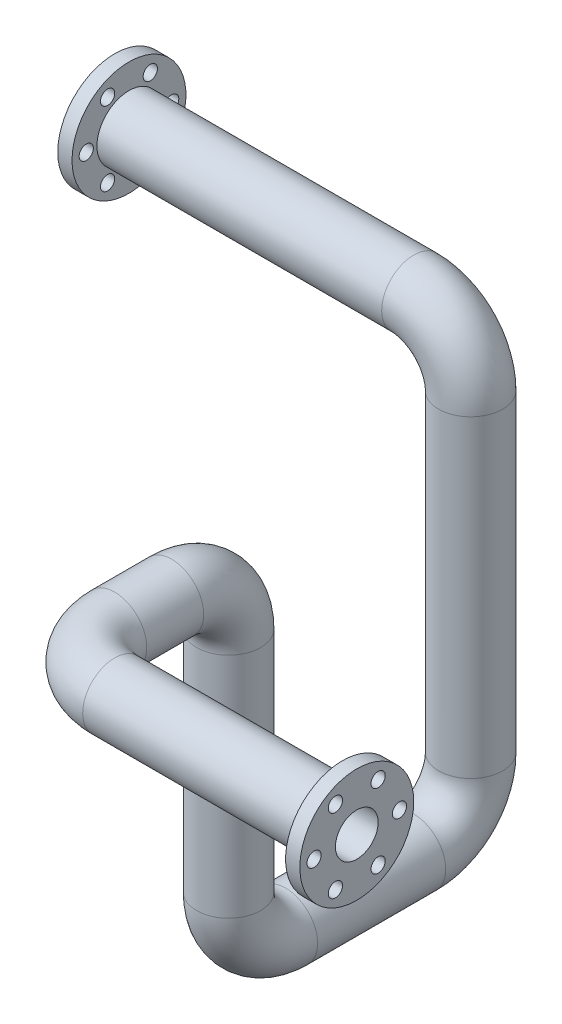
ISO-10303-21;
HEADER;
FILE_DESCRIPTION(('STEP AP214'),'2;1');
FILE_NAME('part.step','',(''),(''),'','','');
FILE_SCHEMA(('AUTOMOTIVE_DESIGN { 1 0 10303 214 1 1 1 1 }'));
ENDSEC;
DATA;
#1=APPLICATION_CONTEXT('core data for automotive mechanical design processes');
#2=APPLICATION_PROTOCOL_DEFINITION('international standard','automotive_design',2000,#1);
#3=PRODUCT_CONTEXT('',#1,'mechanical');
#4=PRODUCT('Part','Part','',(#3));
#5=PRODUCT_RELATED_PRODUCT_CATEGORY('part','',(#4));
#6=PRODUCT_DEFINITION_FORMATION('','',#4);
#7=PRODUCT_DEFINITION_CONTEXT('part definition',#1,'design');
#8=PRODUCT_DEFINITION('design','',#6,#7);
#9=PRODUCT_DEFINITION_SHAPE('','',#8);
#10=(LENGTH_UNIT() NAMED_UNIT(*) SI_UNIT(.MILLI.,.METRE.));
#11=(NAMED_UNIT(*) PLANE_ANGLE_UNIT() SI_UNIT($,.RADIAN.));
#12=(NAMED_UNIT(*) SI_UNIT($,.STERADIAN.) SOLID_ANGLE_UNIT());
#13=UNCERTAINTY_MEASURE_WITH_UNIT(LENGTH_MEASURE(1.E-05),#10,'distance_accuracy_value','');
#14=(GEOMETRIC_REPRESENTATION_CONTEXT(3) GLOBAL_UNCERTAINTY_ASSIGNED_CONTEXT((#13)) GLOBAL_UNIT_ASSIGNED_CONTEXT((#10,
#11,#12)) REPRESENTATION_CONTEXT('',''));
#15=CARTESIAN_POINT('',(0.,0.,0.));
#16=DIRECTION('',(0.,0.,1.));
#17=DIRECTION('',(1.,0.,0.));
#18=AXIS2_PLACEMENT_3D('',#15,#16,#17);
#19=CARTESIAN_POINT('',(0.,0.,0.));
#20=DIRECTION('',(1.,0.,0.));
#21=DIRECTION('',(0.,0.,-1.));
#22=AXIS2_PLACEMENT_3D('',#19,#20,#21);
#23=CYLINDRICAL_SURFACE('',#22,22.5);
#24=CARTESIAN_POINT('',(200.,0.,0.));
#25=DIRECTION('',(-1.,0.,0.));
#26=DIRECTION('',(0.,-1.,0.));
#27=AXIS2_PLACEMENT_3D('',#24,#25,#26);
#28=CIRCLE('',#27,22.5);
#29=CARTESIAN_POINT('',(200.,22.5,0.));
#30=VERTEX_POINT('',#29);
#31=EDGE_CURVE('E79',#30,#30,#28,.T.);
#32=ORIENTED_EDGE('',*,*,#31,.T.);
#33=EDGE_LOOP('',(#32));
#34=FACE_BOUND('',#33,.T.);
#35=CARTESIAN_POINT('',(0.,0.,0.));
#36=DIRECTION('',(-1.,0.,0.));
#37=DIRECTION('',(0.,-1.,0.));
#38=AXIS2_PLACEMENT_3D('',#35,#36,#37);
#39=CIRCLE('',#38,22.5);
#40=CARTESIAN_POINT('',(0.,-22.5,0.));
#41=VERTEX_POINT('',#40);
#42=EDGE_CURVE('E82',#41,#41,#39,.T.);
#43=ORIENTED_EDGE('',*,*,#42,.F.);
#44=EDGE_LOOP('',(#43));
#45=FACE_BOUND('',#44,.T.);
#46=ADVANCED_FACE('F44',(#34,#45),#23,.T.);
#47=CARTESIAN_POINT('',(200.,-40.,0.));
#48=DIRECTION('',(0.,0.,-1.));
#49=DIRECTION('',(0.,1.,0.));
#50=AXIS2_PLACEMENT_3D('',#47,#48,#49);
#51=TOROIDAL_SURFACE('',#50,40.,22.5);
#52=CARTESIAN_POINT('',(240.,-40.,0.));
#53=DIRECTION('',(0.,1.,0.));
#54=DIRECTION('',(-1.,0.,0.));
#55=AXIS2_PLACEMENT_3D('',#52,#53,#54);
#56=CIRCLE('',#55,22.5);
#57=CARTESIAN_POINT('',(262.5,-40.,0.));
#58=VERTEX_POINT('',#57);
#59=EDGE_CURVE('E76',#58,#58,#56,.T.);
#60=CARTESIAN_POINT('',(200.,-40.,0.));
#61=DIRECTION('',(0.,0.,-1.));
#62=DIRECTION('',(0.,1.,0.));
#63=AXIS2_PLACEMENT_3D('',#60,#61,#62);
#64=CIRCLE('',#63,62.5);
#65=EDGE_CURVE('',#30,#58,#64,.T.);
#66=ORIENTED_EDGE('',*,*,#31,.F.);
#67=ORIENTED_EDGE('',*,*,#59,.T.);
#68=ORIENTED_EDGE('',*,*,#65,.T.);
#69=ORIENTED_EDGE('',*,*,#65,.F.);
#70=EDGE_LOOP('',(#66,#68,#67,#69));
#71=FACE_BOUND('',#70,.T.);
#72=ADVANCED_FACE('F605',(#71),#51,.T.);
#73=CARTESIAN_POINT('',(240.,-40.,0.));
#74=DIRECTION('',(0.,-1.,0.));
#75=DIRECTION('',(0.,0.,-1.));
#76=AXIS2_PLACEMENT_3D('',#73,#74,#75);
#77=CYLINDRICAL_SURFACE('',#76,22.5);
#78=CARTESIAN_POINT('',(240.,-260.,0.));
#79=DIRECTION('',(0.,1.,0.));
#80=DIRECTION('',(-1.,0.,0.));
#81=AXIS2_PLACEMENT_3D('',#78,#79,#80);
#82=CIRCLE('',#81,22.5);
#83=CARTESIAN_POINT('',(240.,-260.,-22.5));
#84=VERTEX_POINT('',#83);
#85=EDGE_CURVE('E73',#84,#84,#82,.T.);
#86=ORIENTED_EDGE('',*,*,#85,.T.);
#87=EDGE_LOOP('',(#86));
#88=FACE_BOUND('',#87,.T.);
#89=ORIENTED_EDGE('',*,*,#59,.F.);
#90=EDGE_LOOP('',(#89));
#91=FACE_BOUND('',#90,.T.);
#92=ADVANCED_FACE('F595',(#88,#91),#77,.T.);
#93=CARTESIAN_POINT('',(240.,-260.,40.));
#94=DIRECTION('',(-1.,0.,0.));
#95=DIRECTION('',(0.,0.,1.));
#96=AXIS2_PLACEMENT_3D('',#93,#94,#95);
#97=TOROIDAL_SURFACE('',#96,40.,22.5);
#98=CARTESIAN_POINT('',(240.,-300.,40.));
#99=DIRECTION('',(0.,0.,-1.));
#100=DIRECTION('',(-1.,0.,0.));
#101=AXIS2_PLACEMENT_3D('',#98,#99,#100);
#102=CIRCLE('',#101,22.5);
#103=CARTESIAN_POINT('',(240.,-322.5,40.));
#104=VERTEX_POINT('',#103);
#105=EDGE_CURVE('E70',#104,#104,#102,.T.);
#106=CARTESIAN_POINT('',(240.,-260.,40.));
#107=DIRECTION('',(-1.,0.,0.));
#108=DIRECTION('',(0.,0.,1.));
#109=AXIS2_PLACEMENT_3D('',#106,#107,#108);
#110=CIRCLE('',#109,62.5);
#111=EDGE_CURVE('',#84,#104,#110,.T.);
#112=ORIENTED_EDGE('',*,*,#85,.F.);
#113=ORIENTED_EDGE('',*,*,#105,.T.);
#114=ORIENTED_EDGE('',*,*,#111,.T.);
#115=ORIENTED_EDGE('',*,*,#111,.F.);
#116=EDGE_LOOP('',(#112,#114,#113,#115));
#117=FACE_BOUND('',#116,.T.);
#118=ADVANCED_FACE('F585',(#117),#97,.T.);
#119=CARTESIAN_POINT('',(240.,-300.,40.));
#120=DIRECTION('',(0.,0.,1.));
#121=DIRECTION('',(1.,0.,0.));
#122=AXIS2_PLACEMENT_3D('',#119,#120,#121);
#123=CYLINDRICAL_SURFACE('',#122,22.5);
#124=CARTESIAN_POINT('',(240.,-300.,130.));
#125=DIRECTION('',(0.,0.,-1.));
#126=DIRECTION('',(-1.,0.,0.));
#127=AXIS2_PLACEMENT_3D('',#124,#125,#126);
#128=CIRCLE('',#127,22.5);
#129=CARTESIAN_POINT('',(240.,-322.5,130.));
#130=VERTEX_POINT('',#129);
#131=EDGE_CURVE('E67',#130,#130,#128,.T.);
#132=ORIENTED_EDGE('',*,*,#131,.T.);
#133=EDGE_LOOP('',(#132));
#134=FACE_BOUND('',#133,.T.);
#135=ORIENTED_EDGE('',*,*,#105,.F.);
#136=EDGE_LOOP('',(#135));
#137=FACE_BOUND('',#136,.T.);
#138=ADVANCED_FACE('F575',(#134,#137),#123,.T.);
#139=CARTESIAN_POINT('',(240.,-260.,130.));
#140=DIRECTION('',(-1.,0.,0.));
#141=DIRECTION('',(0.,0.,1.));
#142=AXIS2_PLACEMENT_3D('',#139,#140,#141);
#143=TOROIDAL_SURFACE('',#142,40.,22.5);
#144=CARTESIAN_POINT('',(240.,-260.,170.));
#145=DIRECTION('',(0.,-1.,0.));
#146=DIRECTION('',(-1.,0.,0.));
#147=AXIS2_PLACEMENT_3D('',#144,#145,#146);
#148=CIRCLE('',#147,22.5);
#149=CARTESIAN_POINT('',(240.,-260.,192.5));
#150=VERTEX_POINT('',#149);
#151=EDGE_CURVE('E64',#150,#150,#148,.T.);
#152=CARTESIAN_POINT('',(240.,-260.,130.));
#153=DIRECTION('',(-1.,0.,0.));
#154=DIRECTION('',(0.,0.,1.));
#155=AXIS2_PLACEMENT_3D('',#152,#153,#154);
#156=CIRCLE('',#155,62.5);
#157=EDGE_CURVE('',#130,#150,#156,.T.);
#158=ORIENTED_EDGE('',*,*,#131,.F.);
#159=ORIENTED_EDGE('',*,*,#151,.T.);
#160=ORIENTED_EDGE('',*,*,#157,.T.);
#161=ORIENTED_EDGE('',*,*,#157,.F.);
#162=EDGE_LOOP('',(#158,#160,#159,#161));
#163=FACE_BOUND('',#162,.T.);
#164=ADVANCED_FACE('F565',(#163),#143,.T.);
#165=CARTESIAN_POINT('',(240.,-260.,170.));
#166=DIRECTION('',(0.,1.,0.));
#167=DIRECTION('',(0.,0.,1.));
#168=AXIS2_PLACEMENT_3D('',#165,#166,#167);
#169=CYLINDRICAL_SURFACE('',#168,22.5);
#170=CARTESIAN_POINT('',(240.,-100.,170.));
#171=DIRECTION('',(0.,-1.,0.));
#172=DIRECTION('',(-1.,0.,0.));
#173=AXIS2_PLACEMENT_3D('',#170,#171,#172);
#174=CIRCLE('',#173,22.5);
#175=CARTESIAN_POINT('',(240.,-100.,147.5));
#176=VERTEX_POINT('',#175);
#177=EDGE_CURVE('E61',#176,#176,#174,.T.);
#178=ORIENTED_EDGE('',*,*,#177,.T.);
#179=EDGE_LOOP('',(#178));
#180=FACE_BOUND('',#179,.T.);
#181=ORIENTED_EDGE('',*,*,#151,.F.);
#182=EDGE_LOOP('',(#181));
#183=FACE_BOUND('',#182,.T.);
#184=ADVANCED_FACE('F555',(#180,#183),#169,.T.);
#185=CARTESIAN_POINT('',(240.,-100.,210.));
#186=DIRECTION('',(1.,0.,0.));
#187=DIRECTION('',(0.,0.,-1.));
#188=AXIS2_PLACEMENT_3D('',#185,#186,#187);
#189=TOROIDAL_SURFACE('',#188,40.,22.5);
#190=CARTESIAN_POINT('',(240.,-60.,210.));
#191=DIRECTION('',(0.,0.,-1.));
#192=DIRECTION('',(-1.,0.,0.));
#193=AXIS2_PLACEMENT_3D('',#190,#191,#192);
#194=CIRCLE('',#193,22.5);
#195=CARTESIAN_POINT('',(240.,-37.5,210.));
#196=VERTEX_POINT('',#195);
#197=EDGE_CURVE('E56',#196,#196,#194,.T.);
#198=CARTESIAN_POINT('',(240.,-100.,210.));
#199=DIRECTION('',(1.,0.,0.));
#200=DIRECTION('',(0.,0.,-1.));
#201=AXIS2_PLACEMENT_3D('',#198,#199,#200);
#202=CIRCLE('',#201,62.5);
#203=EDGE_CURVE('',#176,#196,#202,.T.);
#204=ORIENTED_EDGE('',*,*,#177,.F.);
#205=ORIENTED_EDGE('',*,*,#197,.T.);
#206=ORIENTED_EDGE('',*,*,#203,.T.);
#207=ORIENTED_EDGE('',*,*,#203,.F.);
#208=EDGE_LOOP('',(#204,#206,#205,#207));
#209=FACE_BOUND('',#208,.T.);
#210=ADVANCED_FACE('F545',(#209),#189,.T.);
#211=CARTESIAN_POINT('',(240.,-60.,210.));
#212=DIRECTION('',(0.,0.,1.));
#213=DIRECTION('',(0.,-1.,0.));
#214=AXIS2_PLACEMENT_3D('',#211,#212,#213);
#215=CYLINDRICAL_SURFACE('',#214,22.5);
#216=CARTESIAN_POINT('',(240.,-60.,250.));
#217=DIRECTION('',(0.,0.,-1.));
#218=DIRECTION('',(-1.,0.,0.));
#219=AXIS2_PLACEMENT_3D('',#216,#217,#218);
#220=CIRCLE('',#219,22.5);
#221=CARTESIAN_POINT('',(217.5,-60.,250.));
#222=VERTEX_POINT('',#221);
#223=EDGE_CURVE('E52',#222,#222,#220,.T.);
#224=ORIENTED_EDGE('',*,*,#223,.T.);
#225=EDGE_LOOP('',(#224));
#226=FACE_BOUND('',#225,.T.);
#227=ORIENTED_EDGE('',*,*,#197,.F.);
#228=EDGE_LOOP('',(#227));
#229=FACE_BOUND('',#228,.T.);
#230=ADVANCED_FACE('F537',(#226,#229),#215,.T.);
#231=CARTESIAN_POINT('',(280.,-60.,250.));
#232=DIRECTION('',(0.,1.,0.));
#233=DIRECTION('',(0.,0.,1.));
#234=AXIS2_PLACEMENT_3D('',#231,#232,#233);
#235=TOROIDAL_SURFACE('',#234,39.9999999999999,22.5);
#236=CARTESIAN_POINT('',(280.,-60.,290.));
#237=DIRECTION('',(-1.,0.,0.));
#238=DIRECTION('',(0.,0.,1.));
#239=AXIS2_PLACEMENT_3D('',#236,#237,#238);
#240=CIRCLE('',#239,22.5);
#241=CARTESIAN_POINT('',(280.,-60.,312.5));
#242=VERTEX_POINT('',#241);
#243=EDGE_CURVE('E11',#242,#242,#240,.T.);
#244=CARTESIAN_POINT('',(280.,-60.,250.));
#245=DIRECTION('',(0.,1.,0.));
#246=DIRECTION('',(0.,0.,1.));
#247=AXIS2_PLACEMENT_3D('',#244,#245,#246);
#248=CIRCLE('',#247,62.4999999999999);
#249=EDGE_CURVE('',#222,#242,#248,.T.);
#250=ORIENTED_EDGE('',*,*,#223,.F.);
#251=ORIENTED_EDGE('',*,*,#243,.T.);
#252=ORIENTED_EDGE('',*,*,#249,.T.);
#253=ORIENTED_EDGE('',*,*,#249,.F.);
#254=EDGE_LOOP('',(#250,#252,#251,#253));
#255=FACE_BOUND('',#254,.T.);
#256=ADVANCED_FACE('F237',(#255),#235,.T.);
#257=CARTESIAN_POINT('',(280.,-60.,290.));
#258=DIRECTION('',(1.,0.,0.));
#259=DIRECTION('',(0.,0.,-1.));
#260=AXIS2_PLACEMENT_3D('',#257,#258,#259);
#261=CYLINDRICAL_SURFACE('',#260,22.5);
#262=CARTESIAN_POINT('',(440.,-60.,290.));
#263=DIRECTION('',(-1.,0.,0.));
#264=DIRECTION('',(0.,0.,1.));
#265=AXIS2_PLACEMENT_3D('',#262,#263,#264);
#266=CIRCLE('',#265,22.5);
#267=CARTESIAN_POINT('',(440.,-60.,312.5));
#268=VERTEX_POINT('',#267);
#269=EDGE_CURVE('E48',#268,#268,#266,.T.);
#270=ORIENTED_EDGE('',*,*,#269,.T.);
#271=EDGE_LOOP('',(#270));
#272=FACE_BOUND('',#271,.T.);
#273=ORIENTED_EDGE('',*,*,#243,.F.);
#274=EDGE_LOOP('',(#273));
#275=FACE_BOUND('',#274,.T.);
#276=ADVANCED_FACE('F46',(#272,#275),#261,.T.);
#277=CARTESIAN_POINT('',(0.,0.,0.));
#278=DIRECTION('',(1.,0.,0.));
#279=DIRECTION('',(0.,0.,-1.));
#280=AXIS2_PLACEMENT_3D('',#277,#278,#279);
#281=CYLINDRICAL_SURFACE('',#280,15.);
#282=CARTESIAN_POINT('',(200.,0.,0.));
#283=DIRECTION('',(1.,0.,0.));
#284=DIRECTION('',(0.,0.,-1.));
#285=AXIS2_PLACEMENT_3D('',#282,#283,#284);
#286=CIRCLE('',#285,15.);
#287=CARTESIAN_POINT('',(200.,15.,0.));
#288=VERTEX_POINT('',#287);
#289=EDGE_CURVE('E112',#288,#288,#286,.F.);
#290=ORIENTED_EDGE('',*,*,#289,.F.);
#291=EDGE_LOOP('',(#290));
#292=FACE_BOUND('',#291,.T.);
#293=CARTESIAN_POINT('',(-10.,0.,0.));
#294=DIRECTION('',(-1.,0.,0.));
#295=DIRECTION('',(0.,0.,1.));
#296=AXIS2_PLACEMENT_3D('',#293,#294,#295);
#297=CIRCLE('',#296,15.);
#298=CARTESIAN_POINT('',(-10.,0.,15.));
#299=VERTEX_POINT('',#298);
#300=EDGE_CURVE('E128',#299,#299,#297,.T.);
#301=ORIENTED_EDGE('',*,*,#300,.T.);
#302=EDGE_LOOP('',(#301));
#303=FACE_BOUND('',#302,.T.);
#304=ADVANCED_FACE('F224',(#292,#303),#281,.F.);
#305=CARTESIAN_POINT('',(200.,-40.,0.));
#306=DIRECTION('',(0.,0.,-1.));
#307=DIRECTION('',(0.,1.,0.));
#308=AXIS2_PLACEMENT_3D('',#305,#306,#307);
#309=TOROIDAL_SURFACE('',#308,40.,15.);
#310=CARTESIAN_POINT('',(240.,-40.,0.));
#311=DIRECTION('',(0.,1.,0.));
#312=DIRECTION('',(-1.,0.,0.));
#313=AXIS2_PLACEMENT_3D('',#310,#311,#312);
#314=CIRCLE('',#313,15.);
#315=CARTESIAN_POINT('',(255.,-40.,0.));
#316=VERTEX_POINT('',#315);
#317=EDGE_CURVE('E109',#316,#316,#314,.T.);
#318=CARTESIAN_POINT('',(200.,-40.,0.));
#319=DIRECTION('',(0.,0.,-1.));
#320=DIRECTION('',(0.,1.,0.));
#321=AXIS2_PLACEMENT_3D('',#318,#319,#320);
#322=CIRCLE('',#321,55.);
#323=EDGE_CURVE('',#288,#316,#322,.T.);
#324=ORIENTED_EDGE('',*,*,#289,.T.);
#325=ORIENTED_EDGE('',*,*,#317,.F.);
#326=ORIENTED_EDGE('',*,*,#323,.T.);
#327=ORIENTED_EDGE('',*,*,#323,.F.);
#328=EDGE_LOOP('',(#324,#326,#325,#327));
#329=FACE_BOUND('',#328,.T.);
#330=ADVANCED_FACE('F226',(#329),#309,.F.);
#331=CARTESIAN_POINT('',(240.,-40.,0.));
#332=DIRECTION('',(0.,-1.,0.));
#333=DIRECTION('',(0.,0.,-1.));
#334=AXIS2_PLACEMENT_3D('',#331,#332,#333);
#335=CYLINDRICAL_SURFACE('',#334,15.);
#336=CARTESIAN_POINT('',(240.,-260.,0.));
#337=DIRECTION('',(0.,-1.,0.));
#338=DIRECTION('',(0.,0.,-1.));
#339=AXIS2_PLACEMENT_3D('',#336,#337,#338);
#340=CIRCLE('',#339,15.);
#341=CARTESIAN_POINT('',(240.,-260.,-15.));
#342=VERTEX_POINT('',#341);
#343=EDGE_CURVE('E106',#342,#342,#340,.F.);
#344=ORIENTED_EDGE('',*,*,#343,.F.);
#345=EDGE_LOOP('',(#344));
#346=FACE_BOUND('',#345,.T.);
#347=ORIENTED_EDGE('',*,*,#317,.T.);
#348=EDGE_LOOP('',(#347));
#349=FACE_BOUND('',#348,.T.);
#350=ADVANCED_FACE('F234',(#346,#349),#335,.F.);
#351=CARTESIAN_POINT('',(240.,-260.,40.));
#352=DIRECTION('',(-1.,0.,0.));
#353=DIRECTION('',(0.,0.,1.));
#354=AXIS2_PLACEMENT_3D('',#351,#352,#353);
#355=TOROIDAL_SURFACE('',#354,40.,15.);
#356=CARTESIAN_POINT('',(240.,-300.,40.));
#357=DIRECTION('',(0.,0.,-1.));
#358=DIRECTION('',(0.,1.,0.));
#359=AXIS2_PLACEMENT_3D('',#356,#357,#358);
#360=CIRCLE('',#359,15.);
#361=CARTESIAN_POINT('',(240.,-315.,40.));
#362=VERTEX_POINT('',#361);
#363=EDGE_CURVE('E103',#362,#362,#360,.T.);
#364=CARTESIAN_POINT('',(240.,-260.,40.));
#365=DIRECTION('',(-1.,0.,0.));
#366=DIRECTION('',(0.,0.,1.));
#367=AXIS2_PLACEMENT_3D('',#364,#365,#366);
#368=CIRCLE('',#367,55.);
#369=EDGE_CURVE('',#342,#362,#368,.T.);
#370=ORIENTED_EDGE('',*,*,#343,.T.);
#371=ORIENTED_EDGE('',*,*,#363,.F.);
#372=ORIENTED_EDGE('',*,*,#369,.T.);
#373=ORIENTED_EDGE('',*,*,#369,.F.);
#374=EDGE_LOOP('',(#370,#372,#371,#373));
#375=FACE_BOUND('',#374,.T.);
#376=ADVANCED_FACE('F499',(#375),#355,.F.);
#377=CARTESIAN_POINT('',(240.,-300.,40.));
#378=DIRECTION('',(0.,0.,1.));
#379=DIRECTION('',(1.,0.,0.));
#380=AXIS2_PLACEMENT_3D('',#377,#378,#379);
#381=CYLINDRICAL_SURFACE('',#380,15.);
#382=CARTESIAN_POINT('',(240.,-300.,130.));
#383=DIRECTION('',(0.,0.,1.));
#384=DIRECTION('',(1.,0.,0.));
#385=AXIS2_PLACEMENT_3D('',#382,#383,#384);
#386=CIRCLE('',#385,15.);
#387=CARTESIAN_POINT('',(240.,-315.,130.));
#388=VERTEX_POINT('',#387);
#389=EDGE_CURVE('E100',#388,#388,#386,.F.);
#390=ORIENTED_EDGE('',*,*,#389,.F.);
#391=EDGE_LOOP('',(#390));
#392=FACE_BOUND('',#391,.T.);
#393=ORIENTED_EDGE('',*,*,#363,.T.);
#394=EDGE_LOOP('',(#393));
#395=FACE_BOUND('',#394,.T.);
#396=ADVANCED_FACE('F489',(#392,#395),#381,.F.);
#397=CARTESIAN_POINT('',(240.,-260.,130.));
#398=DIRECTION('',(-1.,0.,0.));
#399=DIRECTION('',(0.,0.,1.));
#400=AXIS2_PLACEMENT_3D('',#397,#398,#399);
#401=TOROIDAL_SURFACE('',#400,40.,15.);
#402=CARTESIAN_POINT('',(240.,-260.,170.));
#403=DIRECTION('',(0.,-1.,0.));
#404=DIRECTION('',(0.,0.,-1.));
#405=AXIS2_PLACEMENT_3D('',#402,#403,#404);
#406=CIRCLE('',#405,15.);
#407=CARTESIAN_POINT('',(240.,-260.,185.));
#408=VERTEX_POINT('',#407);
#409=EDGE_CURVE('E97',#408,#408,#406,.T.);
#410=CARTESIAN_POINT('',(240.,-260.,130.));
#411=DIRECTION('',(-1.,0.,0.));
#412=DIRECTION('',(0.,0.,1.));
#413=AXIS2_PLACEMENT_3D('',#410,#411,#412);
#414=CIRCLE('',#413,55.);
#415=EDGE_CURVE('',#388,#408,#414,.T.);
#416=ORIENTED_EDGE('',*,*,#389,.T.);
#417=ORIENTED_EDGE('',*,*,#409,.F.);
#418=ORIENTED_EDGE('',*,*,#415,.T.);
#419=ORIENTED_EDGE('',*,*,#415,.F.);
#420=EDGE_LOOP('',(#416,#418,#417,#419));
#421=FACE_BOUND('',#420,.T.);
#422=ADVANCED_FACE('F479',(#421),#401,.F.);
#423=CARTESIAN_POINT('',(240.,-260.,170.));
#424=DIRECTION('',(0.,1.,0.));
#425=DIRECTION('',(0.,0.,1.));
#426=AXIS2_PLACEMENT_3D('',#423,#424,#425);
#427=CYLINDRICAL_SURFACE('',#426,15.);
#428=CARTESIAN_POINT('',(240.,-100.,170.));
#429=DIRECTION('',(0.,1.,0.));
#430=DIRECTION('',(0.,0.,1.));
#431=AXIS2_PLACEMENT_3D('',#428,#429,#430);
#432=CIRCLE('',#431,15.);
#433=CARTESIAN_POINT('',(240.,-100.,155.));
#434=VERTEX_POINT('',#433);
#435=EDGE_CURVE('E94',#434,#434,#432,.F.);
#436=ORIENTED_EDGE('',*,*,#435,.F.);
#437=EDGE_LOOP('',(#436));
#438=FACE_BOUND('',#437,.T.);
#439=ORIENTED_EDGE('',*,*,#409,.T.);
#440=EDGE_LOOP('',(#439));
#441=FACE_BOUND('',#440,.T.);
#442=ADVANCED_FACE('F469',(#438,#441),#427,.F.);
#443=CARTESIAN_POINT('',(240.,-100.,210.));
#444=DIRECTION('',(1.,0.,0.));
#445=DIRECTION('',(0.,0.,-1.));
#446=AXIS2_PLACEMENT_3D('',#443,#444,#445);
#447=TOROIDAL_SURFACE('',#446,40.,15.);
#448=CARTESIAN_POINT('',(240.,-60.,210.));
#449=DIRECTION('',(0.,0.,-1.));
#450=DIRECTION('',(0.,1.,0.));
#451=AXIS2_PLACEMENT_3D('',#448,#449,#450);
#452=CIRCLE('',#451,15.);
#453=CARTESIAN_POINT('',(240.,-45.,210.));
#454=VERTEX_POINT('',#453);
#455=EDGE_CURVE('E91',#454,#454,#452,.T.);
#456=CARTESIAN_POINT('',(240.,-100.,210.));
#457=DIRECTION('',(1.,0.,0.));
#458=DIRECTION('',(0.,0.,-1.));
#459=AXIS2_PLACEMENT_3D('',#456,#457,#458);
#460=CIRCLE('',#459,55.);
#461=EDGE_CURVE('',#434,#454,#460,.T.);
#462=ORIENTED_EDGE('',*,*,#435,.T.);
#463=ORIENTED_EDGE('',*,*,#455,.F.);
#464=ORIENTED_EDGE('',*,*,#461,.T.);
#465=ORIENTED_EDGE('',*,*,#461,.F.);
#466=EDGE_LOOP('',(#462,#464,#463,#465));
#467=FACE_BOUND('',#466,.T.);
#468=ADVANCED_FACE('F459',(#467),#447,.F.);
#469=CARTESIAN_POINT('',(240.,-60.,210.));
#470=DIRECTION('',(0.,0.,1.));
#471=DIRECTION('',(0.,-1.,0.));
#472=AXIS2_PLACEMENT_3D('',#469,#470,#471);
#473=CYLINDRICAL_SURFACE('',#472,15.);
#474=CARTESIAN_POINT('',(240.,-60.,250.));
#475=DIRECTION('',(0.,0.,1.));
#476=DIRECTION('',(0.,-1.,0.));
#477=AXIS2_PLACEMENT_3D('',#474,#475,#476);
#478=CIRCLE('',#477,15.);
#479=CARTESIAN_POINT('',(225.,-60.,250.));
#480=VERTEX_POINT('',#479);
#481=EDGE_CURVE('E88',#480,#480,#478,.F.);
#482=ORIENTED_EDGE('',*,*,#481,.F.);
#483=EDGE_LOOP('',(#482));
#484=FACE_BOUND('',#483,.T.);
#485=ORIENTED_EDGE('',*,*,#455,.T.);
#486=EDGE_LOOP('',(#485));
#487=FACE_BOUND('',#486,.T.);
#488=ADVANCED_FACE('F449',(#484,#487),#473,.F.);
#489=CARTESIAN_POINT('',(280.,-60.,250.));
#490=DIRECTION('',(0.,1.,0.));
#491=DIRECTION('',(0.,0.,1.));
#492=AXIS2_PLACEMENT_3D('',#489,#490,#491);
#493=TOROIDAL_SURFACE('',#492,39.9999999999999,15.);
#494=CARTESIAN_POINT('',(280.,-60.,290.));
#495=DIRECTION('',(-1.,0.,0.));
#496=DIRECTION('',(0.,0.,1.));
#497=AXIS2_PLACEMENT_3D('',#494,#495,#496);
#498=CIRCLE('',#497,15.);
#499=CARTESIAN_POINT('',(280.,-60.,305.));
#500=VERTEX_POINT('',#499);
#501=EDGE_CURVE('E85',#500,#500,#498,.T.);
#502=CARTESIAN_POINT('',(280.,-60.,250.));
#503=DIRECTION('',(0.,1.,0.));
#504=DIRECTION('',(0.,0.,1.));
#505=AXIS2_PLACEMENT_3D('',#502,#503,#504);
#506=CIRCLE('',#505,54.9999999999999);
#507=EDGE_CURVE('',#480,#500,#506,.T.);
#508=ORIENTED_EDGE('',*,*,#481,.T.);
#509=ORIENTED_EDGE('',*,*,#501,.F.);
#510=ORIENTED_EDGE('',*,*,#507,.T.);
#511=ORIENTED_EDGE('',*,*,#507,.F.);
#512=EDGE_LOOP('',(#508,#510,#509,#511));
#513=FACE_BOUND('',#512,.T.);
#514=ADVANCED_FACE('F252',(#513),#493,.F.);
#515=CARTESIAN_POINT('',(280.,-60.,290.));
#516=DIRECTION('',(1.,0.,0.));
#517=DIRECTION('',(0.,0.,-1.));
#518=AXIS2_PLACEMENT_3D('',#515,#516,#517);
#519=CYLINDRICAL_SURFACE('',#518,15.);
#520=ORIENTED_EDGE('',*,*,#501,.T.);
#521=EDGE_LOOP('',(#520));
#522=FACE_BOUND('',#521,.T.);
#523=CARTESIAN_POINT('',(450.,-60.,290.));
#524=DIRECTION('',(1.,0.,0.));
#525=DIRECTION('',(0.,0.,-1.));
#526=AXIS2_PLACEMENT_3D('',#523,#524,#525);
#527=CIRCLE('',#526,15.);
#528=CARTESIAN_POINT('',(450.,-60.,275.));
#529=VERTEX_POINT('',#528);
#530=EDGE_CURVE('E119',#529,#529,#527,.T.);
#531=ORIENTED_EDGE('',*,*,#530,.T.);
#532=EDGE_LOOP('',(#531));
#533=FACE_BOUND('',#532,.T.);
#534=ADVANCED_FACE('F243',(#522,#533),#519,.F.);
#535=CARTESIAN_POINT('',(450.,-60.,290.));
#536=DIRECTION('',(1.,0.,0.));
#537=DIRECTION('',(0.,0.,-1.));
#538=AXIS2_PLACEMENT_3D('',#535,#536,#537);
#539=PLANE('',#538);
#540=CARTESIAN_POINT('',(450.,-85.9807621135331,275.));
#541=DIRECTION('',(1.,0.,0.));
#542=DIRECTION('',(0.,-0.866025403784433,-0.50000000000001));
#543=AXIS2_PLACEMENT_3D('',#540,#541,#542);
#544=CIRCLE('',#543,4.99999999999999);
#545=CARTESIAN_POINT('',(450.,-85.9807621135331,270.));
#546=VERTEX_POINT('',#545);
#547=EDGE_CURVE('E150',#546,#546,#544,.T.);
#548=ORIENTED_EDGE('',*,*,#547,.F.);
#549=EDGE_LOOP('',(#548));
#550=FACE_BOUND('',#549,.T.);
#551=CARTESIAN_POINT('',(450.,-85.9807621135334,305.));
#552=DIRECTION('',(1.,0.,0.));
#553=DIRECTION('',(0.,-0.866025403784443,0.499999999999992));
#554=AXIS2_PLACEMENT_3D('',#551,#552,#553);
#555=CIRCLE('',#554,4.99999999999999);
#556=CARTESIAN_POINT('',(450.,-85.9807621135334,300.));
#557=VERTEX_POINT('',#556);
#558=EDGE_CURVE('E149',#557,#557,#555,.T.);
#559=ORIENTED_EDGE('',*,*,#558,.F.);
#560=EDGE_LOOP('',(#559));
#561=FACE_BOUND('',#560,.T.);
#562=CARTESIAN_POINT('',(450.,-60.,320.));
#563=DIRECTION('',(1.,0.,0.));
#564=DIRECTION('',(0.,0.,1.));
#565=AXIS2_PLACEMENT_3D('',#562,#563,#564);
#566=CIRCLE('',#565,4.99999999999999);
#567=CARTESIAN_POINT('',(450.,-60.,315.));
#568=VERTEX_POINT('',#567);
#569=EDGE_CURVE('E157',#568,#568,#566,.T.);
#570=ORIENTED_EDGE('',*,*,#569,.F.);
#571=EDGE_LOOP('',(#570));
#572=FACE_BOUND('',#571,.T.);
#573=CARTESIAN_POINT('',(450.,-34.0192378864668,305.));
#574=DIRECTION('',(1.,0.,0.));
#575=DIRECTION('',(0.,0.866025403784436,0.500000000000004));
#576=AXIS2_PLACEMENT_3D('',#573,#574,#575);
#577=CIRCLE('',#576,4.99999999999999);
#578=CARTESIAN_POINT('',(450.,-34.0192378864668,300.));
#579=VERTEX_POINT('',#578);
#580=EDGE_CURVE('E163',#579,#579,#577,.T.);
#581=ORIENTED_EDGE('',*,*,#580,.F.);
#582=EDGE_LOOP('',(#581));
#583=FACE_BOUND('',#582,.T.);
#584=CARTESIAN_POINT('',(450.,-34.0192378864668,275.));
#585=DIRECTION('',(1.,0.,0.));
#586=DIRECTION('',(0.,0.86602540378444,-0.499999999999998));
#587=AXIS2_PLACEMENT_3D('',#584,#585,#586);
#588=CIRCLE('',#587,4.99999999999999);
#589=CARTESIAN_POINT('',(450.,-34.0192378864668,270.));
#590=VERTEX_POINT('',#589);
#591=EDGE_CURVE('E142',#590,#590,#588,.T.);
#592=ORIENTED_EDGE('',*,*,#591,.F.);
#593=EDGE_LOOP('',(#592));
#594=FACE_BOUND('',#593,.T.);
#595=CARTESIAN_POINT('',(450.,-60.,260.));
#596=DIRECTION('',(1.,0.,0.));
#597=DIRECTION('',(0.,0.,-1.));
#598=AXIS2_PLACEMENT_3D('',#595,#596,#597);
#599=CIRCLE('',#598,4.99999999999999);
#600=CARTESIAN_POINT('',(450.,-60.,255.));
#601=VERTEX_POINT('',#600);
#602=EDGE_CURVE('E133',#601,#601,#599,.T.);
#603=ORIENTED_EDGE('',*,*,#602,.F.);
#604=EDGE_LOOP('',(#603));
#605=FACE_BOUND('',#604,.T.);
#606=CARTESIAN_POINT('',(450.,-60.,290.));
#607=DIRECTION('',(1.,0.,0.));
#608=DIRECTION('',(0.,0.,-1.));
#609=AXIS2_PLACEMENT_3D('',#606,#607,#608);
#610=CIRCLE('',#609,40.);
#611=CARTESIAN_POINT('',(450.,-60.,250.));
#612=VERTEX_POINT('',#611);
#613=EDGE_CURVE('E118',#612,#612,#610,.T.);
#614=ORIENTED_EDGE('',*,*,#613,.T.);
#615=EDGE_LOOP('',(#614));
#616=FACE_BOUND('',#615,.T.);
#617=ORIENTED_EDGE('',*,*,#530,.F.);
#618=EDGE_LOOP('',(#617));
#619=FACE_BOUND('',#618,.T.);
#620=ADVANCED_FACE('F229',(#550,#561,#572,#583,#594,#605,#616,#619),#539,.T.);
#621=CARTESIAN_POINT('',(440.,-60.,290.));
#622=DIRECTION('',(1.,0.,0.));
#623=DIRECTION('',(0.,0.,-1.));
#624=AXIS2_PLACEMENT_3D('',#621,#622,#623);
#625=PLANE('',#624);
#626=CARTESIAN_POINT('',(440.,-85.9807621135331,275.));
#627=DIRECTION('',(1.,0.,0.));
#628=DIRECTION('',(0.,0.,-1.));
#629=AXIS2_PLACEMENT_3D('',#626,#627,#628);
#630=CIRCLE('',#629,4.99999999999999);
#631=CARTESIAN_POINT('',(440.,-85.9807621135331,270.));
#632=VERTEX_POINT('',#631);
#633=EDGE_CURVE('E146',#632,#632,#630,.F.);
#634=ORIENTED_EDGE('',*,*,#633,.F.);
#635=EDGE_LOOP('',(#634));
#636=FACE_BOUND('',#635,.T.);
#637=CARTESIAN_POINT('',(440.,-85.9807621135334,305.));
#638=DIRECTION('',(1.,0.,0.));
#639=DIRECTION('',(0.,0.,-1.));
#640=AXIS2_PLACEMENT_3D('',#637,#638,#639);
#641=CIRCLE('',#640,4.99999999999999);
#642=CARTESIAN_POINT('',(440.,-85.9807621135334,300.));
#643=VERTEX_POINT('',#642);
#644=EDGE_CURVE('E154',#643,#643,#641,.F.);
#645=ORIENTED_EDGE('',*,*,#644,.F.);
#646=EDGE_LOOP('',(#645));
#647=FACE_BOUND('',#646,.T.);
#648=CARTESIAN_POINT('',(440.,-60.,320.));
#649=DIRECTION('',(1.,0.,0.));
#650=DIRECTION('',(0.,0.,-1.));
#651=AXIS2_PLACEMENT_3D('',#648,#649,#650);
#652=CIRCLE('',#651,4.99999999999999);
#653=CARTESIAN_POINT('',(440.,-60.,315.));
#654=VERTEX_POINT('',#653);
#655=EDGE_CURVE('E160',#654,#654,#652,.F.);
#656=ORIENTED_EDGE('',*,*,#655,.F.);
#657=EDGE_LOOP('',(#656));
#658=FACE_BOUND('',#657,.T.);
#659=CARTESIAN_POINT('',(440.,-34.0192378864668,305.));
#660=DIRECTION('',(1.,0.,0.));
#661=DIRECTION('',(0.,0.,-1.));
#662=AXIS2_PLACEMENT_3D('',#659,#660,#661);
#663=CIRCLE('',#662,4.99999999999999);
#664=CARTESIAN_POINT('',(440.,-34.0192378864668,300.));
#665=VERTEX_POINT('',#664);
#666=EDGE_CURVE('E145',#665,#665,#663,.F.);
#667=ORIENTED_EDGE('',*,*,#666,.F.);
#668=EDGE_LOOP('',(#667));
#669=FACE_BOUND('',#668,.T.);
#670=CARTESIAN_POINT('',(440.,-34.0192378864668,275.));
#671=DIRECTION('',(1.,0.,0.));
#672=DIRECTION('',(0.,0.,-1.));
#673=AXIS2_PLACEMENT_3D('',#670,#671,#672);
#674=CIRCLE('',#673,4.99999999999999);
#675=CARTESIAN_POINT('',(440.,-34.0192378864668,270.));
#676=VERTEX_POINT('',#675);
#677=EDGE_CURVE('E139',#676,#676,#674,.F.);
#678=ORIENTED_EDGE('',*,*,#677,.F.);
#679=EDGE_LOOP('',(#678));
#680=FACE_BOUND('',#679,.T.);
#681=CARTESIAN_POINT('',(440.,-60.,260.));
#682=DIRECTION('',(1.,0.,0.));
#683=DIRECTION('',(0.,0.,-1.));
#684=AXIS2_PLACEMENT_3D('',#681,#682,#683);
#685=CIRCLE('',#684,4.99999999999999);
#686=CARTESIAN_POINT('',(440.,-60.,255.));
#687=VERTEX_POINT('',#686);
#688=EDGE_CURVE('E136',#687,#687,#685,.F.);
#689=ORIENTED_EDGE('',*,*,#688,.F.);
#690=EDGE_LOOP('',(#689));
#691=FACE_BOUND('',#690,.T.);
#692=ORIENTED_EDGE('',*,*,#269,.F.);
#693=EDGE_LOOP('',(#692));
#694=FACE_BOUND('',#693,.T.);
#695=CARTESIAN_POINT('',(440.,-60.,290.));
#696=DIRECTION('',(1.,0.,0.));
#697=DIRECTION('',(0.,0.,-1.));
#698=AXIS2_PLACEMENT_3D('',#695,#696,#697);
#699=CIRCLE('',#698,40.);
#700=CARTESIAN_POINT('',(440.,-60.,250.));
#701=VERTEX_POINT('',#700);
#702=EDGE_CURVE('E115',#701,#701,#699,.T.);
#703=ORIENTED_EDGE('',*,*,#702,.F.);
#704=EDGE_LOOP('',(#703));
#705=FACE_BOUND('',#704,.T.);
#706=ADVANCED_FACE('F242',(#636,#647,#658,#669,#680,#691,#694,#705),#625,.F.);
#707=CARTESIAN_POINT('',(450.,-60.,290.));
#708=DIRECTION('',(-1.,0.,0.));
#709=DIRECTION('',(0.,0.,1.));
#710=AXIS2_PLACEMENT_3D('',#707,#708,#709);
#711=CYLINDRICAL_SURFACE('',#710,40.);
#712=ORIENTED_EDGE('',*,*,#613,.F.);
#713=EDGE_LOOP('',(#712));
#714=FACE_BOUND('',#713,.T.);
#715=ORIENTED_EDGE('',*,*,#702,.T.);
#716=EDGE_LOOP('',(#715));
#717=FACE_BOUND('',#716,.T.);
#718=ADVANCED_FACE('F213',(#714,#717),#711,.T.);
#719=CARTESIAN_POINT('',(-10.,0.,0.));
#720=DIRECTION('',(-1.,0.,0.));
#721=DIRECTION('',(0.,0.,1.));
#722=AXIS2_PLACEMENT_3D('',#719,#720,#721);
#723=PLANE('',#722);
#724=CARTESIAN_POINT('',(-10.,25.980762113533,15.0000000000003));
#725=DIRECTION('',(-1.,0.,0.));
#726=DIRECTION('',(0.,0.866025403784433,0.50000000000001));
#727=AXIS2_PLACEMENT_3D('',#724,#725,#726);
#728=CIRCLE('',#727,5.);
#729=CARTESIAN_POINT('',(-9.99999999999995,25.980762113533,20.0000000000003));
#730=VERTEX_POINT('',#729);
#731=EDGE_CURVE('E186',#730,#730,#728,.T.);
#732=ORIENTED_EDGE('',*,*,#731,.F.);
#733=EDGE_LOOP('',(#732));
#734=FACE_BOUND('',#733,.T.);
#735=CARTESIAN_POINT('',(-10.,25.9807621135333,-14.9999999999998));
#736=DIRECTION('',(-1.,0.,0.));
#737=DIRECTION('',(0.,0.866025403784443,-0.499999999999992));
#738=AXIS2_PLACEMENT_3D('',#735,#736,#737);
#739=CIRCLE('',#738,5.);
#740=CARTESIAN_POINT('',(-9.99999999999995,25.9807621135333,-9.99999999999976));
#741=VERTEX_POINT('',#740);
#742=EDGE_CURVE('E185',#741,#741,#739,.T.);
#743=ORIENTED_EDGE('',*,*,#742,.F.);
#744=EDGE_LOOP('',(#743));
#745=FACE_BOUND('',#744,.T.);
#746=CARTESIAN_POINT('',(-10.,0.,-30.));
#747=DIRECTION('',(-1.,0.,0.));
#748=DIRECTION('',(0.,0.,-1.));
#749=AXIS2_PLACEMENT_3D('',#746,#747,#748);
#750=CIRCLE('',#749,5.);
#751=CARTESIAN_POINT('',(-9.99999999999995,0.,-25.));
#752=VERTEX_POINT('',#751);
#753=EDGE_CURVE('E192',#752,#752,#750,.T.);
#754=ORIENTED_EDGE('',*,*,#753,.F.);
#755=EDGE_LOOP('',(#754));
#756=FACE_BOUND('',#755,.T.);
#757=CARTESIAN_POINT('',(-10.,-25.9807621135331,-15.0000000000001));
#758=DIRECTION('',(-1.,0.,0.));
#759=DIRECTION('',(0.,-0.866025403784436,-0.500000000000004));
#760=AXIS2_PLACEMENT_3D('',#757,#758,#759);
#761=CIRCLE('',#760,5.);
#762=CARTESIAN_POINT('',(-9.99999999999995,-25.9807621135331,-10.0000000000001));
#763=VERTEX_POINT('',#762);
#764=EDGE_CURVE('E198',#763,#763,#761,.T.);
#765=ORIENTED_EDGE('',*,*,#764,.F.);
#766=EDGE_LOOP('',(#765));
#767=FACE_BOUND('',#766,.T.);
#768=CARTESIAN_POINT('',(-10.,-25.9807621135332,14.9999999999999));
#769=DIRECTION('',(-1.,0.,0.));
#770=DIRECTION('',(0.,-0.86602540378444,0.499999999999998));
#771=AXIS2_PLACEMENT_3D('',#768,#769,#770);
#772=CIRCLE('',#771,5.);
#773=CARTESIAN_POINT('',(-9.99999999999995,-25.9807621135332,19.9999999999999));
#774=VERTEX_POINT('',#773);
#775=EDGE_CURVE('E178',#774,#774,#772,.T.);
#776=ORIENTED_EDGE('',*,*,#775,.F.);
#777=EDGE_LOOP('',(#776));
#778=FACE_BOUND('',#777,.T.);
#779=CARTESIAN_POINT('',(-10.,0.,30.));
#780=DIRECTION('',(-1.,0.,0.));
#781=DIRECTION('',(0.,0.,1.));
#782=AXIS2_PLACEMENT_3D('',#779,#780,#781);
#783=CIRCLE('',#782,5.);
#784=CARTESIAN_POINT('',(-9.99999999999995,0.,35.));
#785=VERTEX_POINT('',#784);
#786=EDGE_CURVE('E172',#785,#785,#783,.T.);
#787=ORIENTED_EDGE('',*,*,#786,.F.);
#788=EDGE_LOOP('',(#787));
#789=FACE_BOUND('',#788,.T.);
#790=CARTESIAN_POINT('',(-10.,0.,0.));
#791=DIRECTION('',(-1.,0.,0.));
#792=DIRECTION('',(0.,0.,1.));
#793=AXIS2_PLACEMENT_3D('',#790,#791,#792);
#794=CIRCLE('',#793,40.);
#795=CARTESIAN_POINT('',(-10.,0.,40.));
#796=VERTEX_POINT('',#795);
#797=EDGE_CURVE('E124',#796,#796,#794,.T.);
#798=ORIENTED_EDGE('',*,*,#797,.T.);
#799=EDGE_LOOP('',(#798));
#800=FACE_BOUND('',#799,.T.);
#801=ORIENTED_EDGE('',*,*,#300,.F.);
#802=EDGE_LOOP('',(#801));
#803=FACE_BOUND('',#802,.T.);
#804=ADVANCED_FACE('F209',(#734,#745,#756,#767,#778,#789,#800,#803),#723,.T.);
#805=CARTESIAN_POINT('',(0.,0.,0.));
#806=DIRECTION('',(-1.,0.,0.));
#807=DIRECTION('',(0.,0.,1.));
#808=AXIS2_PLACEMENT_3D('',#805,#806,#807);
#809=PLANE('',#808);
#810=CARTESIAN_POINT('',(0.,25.980762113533,15.0000000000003));
#811=DIRECTION('',(-1.,0.,0.));
#812=DIRECTION('',(0.,0.,1.));
#813=AXIS2_PLACEMENT_3D('',#810,#811,#812);
#814=CIRCLE('',#813,5.);
#815=CARTESIAN_POINT('',(0.,25.980762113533,20.0000000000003));
#816=VERTEX_POINT('',#815);
#817=EDGE_CURVE('E182',#816,#816,#814,.F.);
#818=ORIENTED_EDGE('',*,*,#817,.F.);
#819=EDGE_LOOP('',(#818));
#820=FACE_BOUND('',#819,.T.);
#821=CARTESIAN_POINT('',(0.,25.9807621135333,-14.9999999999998));
#822=DIRECTION('',(-1.,0.,0.));
#823=DIRECTION('',(0.,0.,1.));
#824=AXIS2_PLACEMENT_3D('',#821,#822,#823);
#825=CIRCLE('',#824,5.);
#826=CARTESIAN_POINT('',(0.,25.9807621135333,-9.99999999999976));
#827=VERTEX_POINT('',#826);
#828=EDGE_CURVE('E189',#827,#827,#825,.F.);
#829=ORIENTED_EDGE('',*,*,#828,.F.);
#830=EDGE_LOOP('',(#829));
#831=FACE_BOUND('',#830,.T.);
#832=CARTESIAN_POINT('',(0.,0.,-30.));
#833=DIRECTION('',(-1.,0.,0.));
#834=DIRECTION('',(0.,0.,1.));
#835=AXIS2_PLACEMENT_3D('',#832,#833,#834);
#836=CIRCLE('',#835,5.);
#837=CARTESIAN_POINT('',(0.,0.,-25.));
#838=VERTEX_POINT('',#837);
#839=EDGE_CURVE('E195',#838,#838,#836,.F.);
#840=ORIENTED_EDGE('',*,*,#839,.F.);
#841=EDGE_LOOP('',(#840));
#842=FACE_BOUND('',#841,.T.);
#843=CARTESIAN_POINT('',(0.,-25.9807621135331,-15.0000000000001));
#844=DIRECTION('',(-1.,0.,0.));
#845=DIRECTION('',(0.,0.,1.));
#846=AXIS2_PLACEMENT_3D('',#843,#844,#845);
#847=CIRCLE('',#846,5.);
#848=CARTESIAN_POINT('',(0.,-25.9807621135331,-10.0000000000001));
#849=VERTEX_POINT('',#848);
#850=EDGE_CURVE('E181',#849,#849,#847,.F.);
#851=ORIENTED_EDGE('',*,*,#850,.F.);
#852=EDGE_LOOP('',(#851));
#853=FACE_BOUND('',#852,.T.);
#854=CARTESIAN_POINT('',(0.,-25.9807621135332,14.9999999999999));
#855=DIRECTION('',(-1.,0.,0.));
#856=DIRECTION('',(0.,0.,1.));
#857=AXIS2_PLACEMENT_3D('',#854,#855,#856);
#858=CIRCLE('',#857,5.);
#859=CARTESIAN_POINT('',(0.,-25.9807621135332,19.9999999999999));
#860=VERTEX_POINT('',#859);
#861=EDGE_CURVE('E175',#860,#860,#858,.F.);
#862=ORIENTED_EDGE('',*,*,#861,.F.);
#863=EDGE_LOOP('',(#862));
#864=FACE_BOUND('',#863,.T.);
#865=CARTESIAN_POINT('',(0.,0.,30.));
#866=DIRECTION('',(-1.,0.,0.));
#867=DIRECTION('',(0.,0.,1.));
#868=AXIS2_PLACEMENT_3D('',#865,#866,#867);
#869=CIRCLE('',#868,5.);
#870=CARTESIAN_POINT('',(0.,0.,35.));
#871=VERTEX_POINT('',#870);
#872=EDGE_CURVE('E153',#871,#871,#869,.F.);
#873=ORIENTED_EDGE('',*,*,#872,.F.);
#874=EDGE_LOOP('',(#873));
#875=FACE_BOUND('',#874,.T.);
#876=ORIENTED_EDGE('',*,*,#42,.T.);
#877=EDGE_LOOP('',(#876));
#878=FACE_BOUND('',#877,.T.);
#879=CARTESIAN_POINT('',(0.,0.,0.));
#880=DIRECTION('',(-1.,0.,0.));
#881=DIRECTION('',(0.,0.,1.));
#882=AXIS2_PLACEMENT_3D('',#879,#880,#881);
#883=CIRCLE('',#882,40.);
#884=CARTESIAN_POINT('',(0.,0.,40.));
#885=VERTEX_POINT('',#884);
#886=EDGE_CURVE('E125',#885,#885,#883,.T.);
#887=ORIENTED_EDGE('',*,*,#886,.F.);
#888=EDGE_LOOP('',(#887));
#889=FACE_BOUND('',#888,.T.);
#890=ADVANCED_FACE('F212',(#820,#831,#842,#853,#864,#875,#878,#889),#809,.F.);
#891=CARTESIAN_POINT('',(-10.,0.,0.));
#892=DIRECTION('',(1.,0.,0.));
#893=DIRECTION('',(0.,0.,-1.));
#894=AXIS2_PLACEMENT_3D('',#891,#892,#893);
#895=CYLINDRICAL_SURFACE('',#894,40.);
#896=ORIENTED_EDGE('',*,*,#797,.F.);
#897=EDGE_LOOP('',(#896));
#898=FACE_BOUND('',#897,.T.);
#899=ORIENTED_EDGE('',*,*,#886,.T.);
#900=EDGE_LOOP('',(#899));
#901=FACE_BOUND('',#900,.T.);
#902=ADVANCED_FACE('F258',(#898,#901),#895,.T.);
#903=CARTESIAN_POINT('',(-10.001,-60.,260.));
#904=DIRECTION('',(1.,0.,0.));
#905=DIRECTION('',(0.,0.,-1.));
#906=AXIS2_PLACEMENT_3D('',#903,#904,#905);
#907=CYLINDRICAL_SURFACE('',#906,4.99999999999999);
#908=CARTESIAN_POINT('',(450.,-60.,255.));
#909=CARTESIAN_POINT('',(449.895833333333,-60.,255.));
#910=CARTESIAN_POINT('',(449.791666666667,-60.,255.));
#911=CARTESIAN_POINT('',(449.583333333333,-60.,255.));
#912=CARTESIAN_POINT('',(449.479166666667,-60.,255.));
#913=CARTESIAN_POINT('',(449.270833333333,-60.,255.));
#914=CARTESIAN_POINT('',(449.166666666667,-60.,255.));
#915=CARTESIAN_POINT('',(448.958333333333,-60.,255.));
#916=CARTESIAN_POINT('',(448.854166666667,-60.,255.));
#917=CARTESIAN_POINT('',(448.645833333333,-60.,255.));
#918=CARTESIAN_POINT('',(448.541666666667,-60.,255.));
#919=CARTESIAN_POINT('',(448.333333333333,-60.,255.));
#920=CARTESIAN_POINT('',(448.229166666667,-60.,255.));
#921=CARTESIAN_POINT('',(448.020833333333,-60.,255.));
#922=CARTESIAN_POINT('',(447.916666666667,-60.,255.));
#923=CARTESIAN_POINT('',(447.708333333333,-60.,255.));
#924=CARTESIAN_POINT('',(447.604166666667,-60.,255.));
#925=CARTESIAN_POINT('',(447.395833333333,-60.,255.));
#926=CARTESIAN_POINT('',(447.291666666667,-60.,255.));
#927=CARTESIAN_POINT('',(447.083333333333,-60.,255.));
#928=CARTESIAN_POINT('',(446.979166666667,-60.,255.));
#929=CARTESIAN_POINT('',(446.770833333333,-60.,255.));
#930=CARTESIAN_POINT('',(446.666666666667,-60.,255.));
#931=CARTESIAN_POINT('',(446.458333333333,-60.,255.));
#932=CARTESIAN_POINT('',(446.354166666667,-60.,255.));
#933=CARTESIAN_POINT('',(446.145833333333,-60.,255.));
#934=CARTESIAN_POINT('',(446.041666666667,-60.,255.));
#935=CARTESIAN_POINT('',(445.833333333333,-60.,255.));
#936=CARTESIAN_POINT('',(445.729166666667,-60.,255.));
#937=CARTESIAN_POINT('',(445.520833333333,-60.,255.));
#938=CARTESIAN_POINT('',(445.416666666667,-60.,255.));
#939=CARTESIAN_POINT('',(445.208333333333,-60.,255.));
#940=CARTESIAN_POINT('',(445.104166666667,-60.,255.));
#941=CARTESIAN_POINT('',(444.895833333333,-60.,255.));
#942=CARTESIAN_POINT('',(444.791666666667,-60.,255.));
#943=CARTESIAN_POINT('',(444.583333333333,-60.,255.));
#944=CARTESIAN_POINT('',(444.479166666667,-60.,255.));
#945=CARTESIAN_POINT('',(444.270833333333,-60.,255.));
#946=CARTESIAN_POINT('',(444.166666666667,-60.,255.));
#947=CARTESIAN_POINT('',(443.958333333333,-60.,255.));
#948=CARTESIAN_POINT('',(443.854166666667,-60.,255.));
#949=CARTESIAN_POINT('',(443.645833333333,-60.,255.));
#950=CARTESIAN_POINT('',(443.541666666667,-60.,255.));
#951=CARTESIAN_POINT('',(443.333333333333,-60.,255.));
#952=CARTESIAN_POINT('',(443.229166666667,-60.,255.));
#953=CARTESIAN_POINT('',(443.020833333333,-60.,255.));
#954=CARTESIAN_POINT('',(442.916666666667,-60.,255.));
#955=CARTESIAN_POINT('',(442.708333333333,-60.,255.));
#956=CARTESIAN_POINT('',(442.604166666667,-60.,255.));
#957=CARTESIAN_POINT('',(442.395833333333,-60.,255.));
#958=CARTESIAN_POINT('',(442.291666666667,-60.,255.));
#959=CARTESIAN_POINT('',(442.083333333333,-60.,255.));
#960=CARTESIAN_POINT('',(441.979166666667,-60.,255.));
#961=CARTESIAN_POINT('',(441.770833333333,-60.,255.));
#962=CARTESIAN_POINT('',(441.666666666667,-60.,255.));
#963=CARTESIAN_POINT('',(441.458333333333,-60.,255.));
#964=CARTESIAN_POINT('',(441.354166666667,-60.,255.));
#965=CARTESIAN_POINT('',(441.145833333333,-60.,255.));
#966=CARTESIAN_POINT('',(441.041666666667,-60.,255.));
#967=CARTESIAN_POINT('',(440.833333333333,-60.,255.));
#968=CARTESIAN_POINT('',(440.729166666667,-60.,255.));
#969=CARTESIAN_POINT('',(440.520833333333,-60.,255.));
#970=CARTESIAN_POINT('',(440.416666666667,-60.,255.));
#971=CARTESIAN_POINT('',(440.208333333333,-60.,255.));
#972=CARTESIAN_POINT('',(440.104166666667,-60.,255.));
#973=CARTESIAN_POINT('',(440.,-60.,255.));
#974=B_SPLINE_CURVE_WITH_KNOTS('',3,(#908,#909,#910,#911,#912,#913,#914,#915,#916,#917,#918,
#919,#920,#921,#922,#923,#924,#925,#926,#927,#928,#929,#930,#931,#932,#933,#934,#935,#936,#937,
#938,#939,#940,#941,#942,#943,#944,#945,#946,#947,#948,#949,#950,#951,#952,#953,#954,#955,#956,
#957,#958,#959,#960,#961,#962,#963,#964,#965,#966,#967,#968,#969,#970,#971,#972,#973),
.UNSPECIFIED.,.F.,.F.,(4,2,2,2,2,2,2,2,2,2,2,2,2,2,2,2,2,2,2,2,2,2,2,2,2,2,2,2,2,2,2,2,4),(0.,
0.312499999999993,0.624999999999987,0.93749999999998,1.24999999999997,1.56250000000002,
1.87500000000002,2.18750000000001,2.5,2.8125,3.12499999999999,3.43749999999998,3.75000000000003,
4.06250000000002,4.37500000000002,4.68750000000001,5.,5.3125,5.62499999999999,5.93749999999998,
6.24999999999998,6.56250000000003,6.87500000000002,7.18750000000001,7.50000000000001,7.8125,
8.12499999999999,8.43749999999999,8.75000000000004,9.06250000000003,9.37500000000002,
9.68750000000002,10.),.UNSPECIFIED.);
#975=EDGE_CURVE('BSEAM293',#601,#687,#974,.T.);
#976=ORIENTED_EDGE('',*,*,#602,.T.);
#977=ORIENTED_EDGE('',*,*,#688,.T.);
#978=ORIENTED_EDGE('',*,*,#975,.T.);
#979=ORIENTED_EDGE('',*,*,#975,.F.);
#980=EDGE_LOOP('',(#976,#978,#977,#979));
#981=FACE_BOUND('',#980,.T.);
#982=ADVANCED_FACE('F293',(#981),#907,.F.);
#983=CARTESIAN_POINT('',(-10.001,-34.0192378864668,275.));
#984=DIRECTION('',(1.,0.,0.));
#985=DIRECTION('',(0.,0.,-1.));
#986=AXIS2_PLACEMENT_3D('',#983,#984,#985);
#987=CYLINDRICAL_SURFACE('',#986,4.99999999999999);
#988=CARTESIAN_POINT('',(450.,-34.0192378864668,270.));
#989=CARTESIAN_POINT('',(449.895833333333,-34.0192378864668,270.));
#990=CARTESIAN_POINT('',(449.791666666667,-34.0192378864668,270.));
#991=CARTESIAN_POINT('',(449.583333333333,-34.0192378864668,270.));
#992=CARTESIAN_POINT('',(449.479166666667,-34.0192378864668,270.));
#993=CARTESIAN_POINT('',(449.270833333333,-34.0192378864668,270.));
#994=CARTESIAN_POINT('',(449.166666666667,-34.0192378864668,270.));
#995=CARTESIAN_POINT('',(448.958333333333,-34.0192378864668,270.));
#996=CARTESIAN_POINT('',(448.854166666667,-34.0192378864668,270.));
#997=CARTESIAN_POINT('',(448.645833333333,-34.0192378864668,270.));
#998=CARTESIAN_POINT('',(448.541666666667,-34.0192378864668,270.));
#999=CARTESIAN_POINT('',(448.333333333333,-34.0192378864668,270.));
#1000=CARTESIAN_POINT('',(448.229166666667,-34.0192378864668,270.));
#1001=CARTESIAN_POINT('',(448.020833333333,-34.0192378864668,270.));
#1002=CARTESIAN_POINT('',(447.916666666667,-34.0192378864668,270.));
#1003=CARTESIAN_POINT('',(447.708333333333,-34.0192378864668,270.));
#1004=CARTESIAN_POINT('',(447.604166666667,-34.0192378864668,270.));
#1005=CARTESIAN_POINT('',(447.395833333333,-34.0192378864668,270.));
#1006=CARTESIAN_POINT('',(447.291666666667,-34.0192378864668,270.));
#1007=CARTESIAN_POINT('',(447.083333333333,-34.0192378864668,270.));
#1008=CARTESIAN_POINT('',(446.979166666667,-34.0192378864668,270.));
#1009=CARTESIAN_POINT('',(446.770833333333,-34.0192378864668,270.));
#1010=CARTESIAN_POINT('',(446.666666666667,-34.0192378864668,270.));
#1011=CARTESIAN_POINT('',(446.458333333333,-34.0192378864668,270.));
#1012=CARTESIAN_POINT('',(446.354166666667,-34.0192378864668,270.));
#1013=CARTESIAN_POINT('',(446.145833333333,-34.0192378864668,270.));
#1014=CARTESIAN_POINT('',(446.041666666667,-34.0192378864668,270.));
#1015=CARTESIAN_POINT('',(445.833333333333,-34.0192378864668,270.));
#1016=CARTESIAN_POINT('',(445.729166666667,-34.0192378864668,270.));
#1017=CARTESIAN_POINT('',(445.520833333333,-34.0192378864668,270.));
#1018=CARTESIAN_POINT('',(445.416666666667,-34.0192378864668,270.));
#1019=CARTESIAN_POINT('',(445.208333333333,-34.0192378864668,270.));
#1020=CARTESIAN_POINT('',(445.104166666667,-34.0192378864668,270.));
#1021=CARTESIAN_POINT('',(444.895833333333,-34.0192378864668,270.));
#1022=CARTESIAN_POINT('',(444.791666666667,-34.0192378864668,270.));
#1023=CARTESIAN_POINT('',(444.583333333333,-34.0192378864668,270.));
#1024=CARTESIAN_POINT('',(444.479166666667,-34.0192378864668,270.));
#1025=CARTESIAN_POINT('',(444.270833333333,-34.0192378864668,270.));
#1026=CARTESIAN_POINT('',(444.166666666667,-34.0192378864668,270.));
#1027=CARTESIAN_POINT('',(443.958333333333,-34.0192378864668,270.));
#1028=CARTESIAN_POINT('',(443.854166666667,-34.0192378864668,270.));
#1029=CARTESIAN_POINT('',(443.645833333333,-34.0192378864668,270.));
#1030=CARTESIAN_POINT('',(443.541666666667,-34.0192378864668,270.));
#1031=CARTESIAN_POINT('',(443.333333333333,-34.0192378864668,270.));
#1032=CARTESIAN_POINT('',(443.229166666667,-34.0192378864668,270.));
#1033=CARTESIAN_POINT('',(443.020833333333,-34.0192378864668,270.));
#1034=CARTESIAN_POINT('',(442.916666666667,-34.0192378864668,270.));
#1035=CARTESIAN_POINT('',(442.708333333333,-34.0192378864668,270.));
#1036=CARTESIAN_POINT('',(442.604166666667,-34.0192378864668,270.));
#1037=CARTESIAN_POINT('',(442.395833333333,-34.0192378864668,270.));
#1038=CARTESIAN_POINT('',(442.291666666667,-34.0192378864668,270.));
#1039=CARTESIAN_POINT('',(442.083333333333,-34.0192378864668,270.));
#1040=CARTESIAN_POINT('',(441.979166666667,-34.0192378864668,270.));
#1041=CARTESIAN_POINT('',(441.770833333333,-34.0192378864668,270.));
#1042=CARTESIAN_POINT('',(441.666666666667,-34.0192378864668,270.));
#1043=CARTESIAN_POINT('',(441.458333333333,-34.0192378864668,270.));
#1044=CARTESIAN_POINT('',(441.354166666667,-34.0192378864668,270.));
#1045=CARTESIAN_POINT('',(441.145833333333,-34.0192378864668,270.));
#1046=CARTESIAN_POINT('',(441.041666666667,-34.0192378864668,270.));
#1047=CARTESIAN_POINT('',(440.833333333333,-34.0192378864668,270.));
#1048=CARTESIAN_POINT('',(440.729166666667,-34.0192378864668,270.));
#1049=CARTESIAN_POINT('',(440.520833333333,-34.0192378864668,270.));
#1050=CARTESIAN_POINT('',(440.416666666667,-34.0192378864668,270.));
#1051=CARTESIAN_POINT('',(440.208333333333,-34.0192378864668,270.));
#1052=CARTESIAN_POINT('',(440.104166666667,-34.0192378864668,270.));
#1053=CARTESIAN_POINT('',(440.,-34.0192378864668,270.));
#1054=B_SPLINE_CURVE_WITH_KNOTS('',3,(#988,#989,#990,#991,#992,#993,#994,#995,#996,#997,#998,
#999,#1000,#1001,#1002,#1003,#1004,#1005,#1006,#1007,#1008,#1009,#1010,#1011,#1012,#1013,#1014,
#1015,#1016,#1017,#1018,#1019,#1020,#1021,#1022,#1023,#1024,#1025,#1026,#1027,#1028,#1029,#1030,
#1031,#1032,#1033,#1034,#1035,#1036,#1037,#1038,#1039,#1040,#1041,#1042,#1043,#1044,#1045,#1046,
#1047,#1048,#1049,#1050,#1051,#1052,#1053),.UNSPECIFIED.,.F.,.F.,(4,2,2,2,2,2,2,2,2,2,2,2,2,2,2,
2,2,2,2,2,2,2,2,2,2,2,2,2,2,2,2,2,4),(0.,0.312499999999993,0.624999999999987,0.93749999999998,
1.24999999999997,1.56250000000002,1.87500000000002,2.18750000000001,2.5,2.8125,3.12499999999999,
3.43749999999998,3.75000000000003,4.06250000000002,4.37500000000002,4.68750000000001,5.,5.3125,
5.62499999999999,5.93749999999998,6.24999999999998,6.56250000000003,6.87500000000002,
7.18750000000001,7.50000000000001,7.8125,8.12499999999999,8.43749999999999,8.75000000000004,
9.06250000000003,9.37500000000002,9.68750000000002,10.),.UNSPECIFIED.);
#1055=EDGE_CURVE('BSEAM300',#590,#676,#1054,.T.);
#1056=ORIENTED_EDGE('',*,*,#591,.T.);
#1057=ORIENTED_EDGE('',*,*,#677,.T.);
#1058=ORIENTED_EDGE('',*,*,#1055,.T.);
#1059=ORIENTED_EDGE('',*,*,#1055,.F.);
#1060=EDGE_LOOP('',(#1056,#1058,#1057,#1059));
#1061=FACE_BOUND('',#1060,.T.);
#1062=ADVANCED_FACE('F300',(#1061),#987,.F.);
#1063=CARTESIAN_POINT('',(-10.001,-34.0192378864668,305.));
#1064=DIRECTION('',(1.,0.,0.));
#1065=DIRECTION('',(0.,0.,-1.));
#1066=AXIS2_PLACEMENT_3D('',#1063,#1064,#1065);
#1067=CYLINDRICAL_SURFACE('',#1066,4.99999999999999);
#1068=CARTESIAN_POINT('',(450.,-34.0192378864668,300.));
#1069=CARTESIAN_POINT('',(449.895833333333,-34.0192378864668,300.));
#1070=CARTESIAN_POINT('',(449.791666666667,-34.0192378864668,300.));
#1071=CARTESIAN_POINT('',(449.583333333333,-34.0192378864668,300.));
#1072=CARTESIAN_POINT('',(449.479166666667,-34.0192378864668,300.));
#1073=CARTESIAN_POINT('',(449.270833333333,-34.0192378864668,300.));
#1074=CARTESIAN_POINT('',(449.166666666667,-34.0192378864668,300.));
#1075=CARTESIAN_POINT('',(448.958333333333,-34.0192378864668,300.));
#1076=CARTESIAN_POINT('',(448.854166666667,-34.0192378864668,300.));
#1077=CARTESIAN_POINT('',(448.645833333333,-34.0192378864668,300.));
#1078=CARTESIAN_POINT('',(448.541666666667,-34.0192378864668,300.));
#1079=CARTESIAN_POINT('',(448.333333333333,-34.0192378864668,300.));
#1080=CARTESIAN_POINT('',(448.229166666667,-34.0192378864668,300.));
#1081=CARTESIAN_POINT('',(448.020833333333,-34.0192378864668,300.));
#1082=CARTESIAN_POINT('',(447.916666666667,-34.0192378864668,300.));
#1083=CARTESIAN_POINT('',(447.708333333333,-34.0192378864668,300.));
#1084=CARTESIAN_POINT('',(447.604166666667,-34.0192378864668,300.));
#1085=CARTESIAN_POINT('',(447.395833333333,-34.0192378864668,300.));
#1086=CARTESIAN_POINT('',(447.291666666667,-34.0192378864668,300.));
#1087=CARTESIAN_POINT('',(447.083333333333,-34.0192378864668,300.));
#1088=CARTESIAN_POINT('',(446.979166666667,-34.0192378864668,300.));
#1089=CARTESIAN_POINT('',(446.770833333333,-34.0192378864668,300.));
#1090=CARTESIAN_POINT('',(446.666666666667,-34.0192378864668,300.));
#1091=CARTESIAN_POINT('',(446.458333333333,-34.0192378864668,300.));
#1092=CARTESIAN_POINT('',(446.354166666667,-34.0192378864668,300.));
#1093=CARTESIAN_POINT('',(446.145833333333,-34.0192378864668,300.));
#1094=CARTESIAN_POINT('',(446.041666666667,-34.0192378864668,300.));
#1095=CARTESIAN_POINT('',(445.833333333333,-34.0192378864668,300.));
#1096=CARTESIAN_POINT('',(445.729166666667,-34.0192378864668,300.));
#1097=CARTESIAN_POINT('',(445.520833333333,-34.0192378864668,300.));
#1098=CARTESIAN_POINT('',(445.416666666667,-34.0192378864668,300.));
#1099=CARTESIAN_POINT('',(445.208333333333,-34.0192378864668,300.));
#1100=CARTESIAN_POINT('',(445.104166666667,-34.0192378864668,300.));
#1101=CARTESIAN_POINT('',(444.895833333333,-34.0192378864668,300.));
#1102=CARTESIAN_POINT('',(444.791666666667,-34.0192378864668,300.));
#1103=CARTESIAN_POINT('',(444.583333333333,-34.0192378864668,300.));
#1104=CARTESIAN_POINT('',(444.479166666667,-34.0192378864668,300.));
#1105=CARTESIAN_POINT('',(444.270833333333,-34.0192378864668,300.));
#1106=CARTESIAN_POINT('',(444.166666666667,-34.0192378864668,300.));
#1107=CARTESIAN_POINT('',(443.958333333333,-34.0192378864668,300.));
#1108=CARTESIAN_POINT('',(443.854166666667,-34.0192378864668,300.));
#1109=CARTESIAN_POINT('',(443.645833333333,-34.0192378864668,300.));
#1110=CARTESIAN_POINT('',(443.541666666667,-34.0192378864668,300.));
#1111=CARTESIAN_POINT('',(443.333333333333,-34.0192378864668,300.));
#1112=CARTESIAN_POINT('',(443.229166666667,-34.0192378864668,300.));
#1113=CARTESIAN_POINT('',(443.020833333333,-34.0192378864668,300.));
#1114=CARTESIAN_POINT('',(442.916666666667,-34.0192378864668,300.));
#1115=CARTESIAN_POINT('',(442.708333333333,-34.0192378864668,300.));
#1116=CARTESIAN_POINT('',(442.604166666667,-34.0192378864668,300.));
#1117=CARTESIAN_POINT('',(442.395833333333,-34.0192378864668,300.));
#1118=CARTESIAN_POINT('',(442.291666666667,-34.0192378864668,300.));
#1119=CARTESIAN_POINT('',(442.083333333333,-34.0192378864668,300.));
#1120=CARTESIAN_POINT('',(441.979166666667,-34.0192378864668,300.));
#1121=CARTESIAN_POINT('',(441.770833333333,-34.0192378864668,300.));
#1122=CARTESIAN_POINT('',(441.666666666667,-34.0192378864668,300.));
#1123=CARTESIAN_POINT('',(441.458333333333,-34.0192378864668,300.));
#1124=CARTESIAN_POINT('',(441.354166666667,-34.0192378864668,300.));
#1125=CARTESIAN_POINT('',(441.145833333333,-34.0192378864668,300.));
#1126=CARTESIAN_POINT('',(441.041666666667,-34.0192378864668,300.));
#1127=CARTESIAN_POINT('',(440.833333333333,-34.0192378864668,300.));
#1128=CARTESIAN_POINT('',(440.729166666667,-34.0192378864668,300.));
#1129=CARTESIAN_POINT('',(440.520833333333,-34.0192378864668,300.));
#1130=CARTESIAN_POINT('',(440.416666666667,-34.0192378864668,300.));
#1131=CARTESIAN_POINT('',(440.208333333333,-34.0192378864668,300.));
#1132=CARTESIAN_POINT('',(440.104166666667,-34.0192378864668,300.));
#1133=CARTESIAN_POINT('',(440.,-34.0192378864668,300.));
#1134=B_SPLINE_CURVE_WITH_KNOTS('',3,(#1068,#1069,#1070,#1071,#1072,#1073,#1074,#1075,#1076,
#1077,#1078,#1079,#1080,#1081,#1082,#1083,#1084,#1085,#1086,#1087,#1088,#1089,#1090,#1091,#1092,
#1093,#1094,#1095,#1096,#1097,#1098,#1099,#1100,#1101,#1102,#1103,#1104,#1105,#1106,#1107,#1108,
#1109,#1110,#1111,#1112,#1113,#1114,#1115,#1116,#1117,#1118,#1119,#1120,#1121,#1122,#1123,#1124,
#1125,#1126,#1127,#1128,#1129,#1130,#1131,#1132,#1133),.UNSPECIFIED.,.F.,.F.,(4,2,2,2,2,2,2,2,2,
2,2,2,2,2,2,2,2,2,2,2,2,2,2,2,2,2,2,2,2,2,2,2,4),(0.,0.312499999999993,0.624999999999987,
0.93749999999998,1.24999999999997,1.56250000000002,1.87500000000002,2.18750000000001,2.5,2.8125,
3.12499999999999,3.43749999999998,3.75000000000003,4.06250000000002,4.37500000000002,
4.68750000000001,5.,5.3125,5.62499999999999,5.93749999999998,6.24999999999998,6.56250000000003,
6.87500000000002,7.18750000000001,7.50000000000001,7.8125,8.12499999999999,8.43749999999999,
8.75000000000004,9.06250000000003,9.37500000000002,9.68750000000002,10.),.UNSPECIFIED.);
#1135=EDGE_CURVE('BSEAM308',#579,#665,#1134,.T.);
#1136=ORIENTED_EDGE('',*,*,#580,.T.);
#1137=ORIENTED_EDGE('',*,*,#666,.T.);
#1138=ORIENTED_EDGE('',*,*,#1135,.T.);
#1139=ORIENTED_EDGE('',*,*,#1135,.F.);
#1140=EDGE_LOOP('',(#1136,#1138,#1137,#1139));
#1141=FACE_BOUND('',#1140,.T.);
#1142=ADVANCED_FACE('F308',(#1141),#1067,.F.);
#1143=CARTESIAN_POINT('',(-10.001,-60.,320.));
#1144=DIRECTION('',(1.,0.,0.));
#1145=DIRECTION('',(0.,0.,-1.));
#1146=AXIS2_PLACEMENT_3D('',#1143,#1144,#1145);
#1147=CYLINDRICAL_SURFACE('',#1146,4.99999999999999);
#1148=CARTESIAN_POINT('',(450.,-60.,315.));
#1149=CARTESIAN_POINT('',(449.895833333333,-60.,315.));
#1150=CARTESIAN_POINT('',(449.791666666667,-60.,315.));
#1151=CARTESIAN_POINT('',(449.583333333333,-60.,315.));
#1152=CARTESIAN_POINT('',(449.479166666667,-60.,315.));
#1153=CARTESIAN_POINT('',(449.270833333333,-60.,315.));
#1154=CARTESIAN_POINT('',(449.166666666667,-60.,315.));
#1155=CARTESIAN_POINT('',(448.958333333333,-60.,315.));
#1156=CARTESIAN_POINT('',(448.854166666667,-60.,315.));
#1157=CARTESIAN_POINT('',(448.645833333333,-60.,315.));
#1158=CARTESIAN_POINT('',(448.541666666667,-60.,315.));
#1159=CARTESIAN_POINT('',(448.333333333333,-60.,315.));
#1160=CARTESIAN_POINT('',(448.229166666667,-60.,315.));
#1161=CARTESIAN_POINT('',(448.020833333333,-60.,315.));
#1162=CARTESIAN_POINT('',(447.916666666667,-60.,315.));
#1163=CARTESIAN_POINT('',(447.708333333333,-60.,315.));
#1164=CARTESIAN_POINT('',(447.604166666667,-60.,315.));
#1165=CARTESIAN_POINT('',(447.395833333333,-60.,315.));
#1166=CARTESIAN_POINT('',(447.291666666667,-60.,315.));
#1167=CARTESIAN_POINT('',(447.083333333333,-60.,315.));
#1168=CARTESIAN_POINT('',(446.979166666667,-60.,315.));
#1169=CARTESIAN_POINT('',(446.770833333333,-60.,315.));
#1170=CARTESIAN_POINT('',(446.666666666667,-60.,315.));
#1171=CARTESIAN_POINT('',(446.458333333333,-60.,315.));
#1172=CARTESIAN_POINT('',(446.354166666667,-60.,315.));
#1173=CARTESIAN_POINT('',(446.145833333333,-60.,315.));
#1174=CARTESIAN_POINT('',(446.041666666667,-60.,315.));
#1175=CARTESIAN_POINT('',(445.833333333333,-60.,315.));
#1176=CARTESIAN_POINT('',(445.729166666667,-60.,315.));
#1177=CARTESIAN_POINT('',(445.520833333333,-60.,315.));
#1178=CARTESIAN_POINT('',(445.416666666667,-60.,315.));
#1179=CARTESIAN_POINT('',(445.208333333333,-60.,315.));
#1180=CARTESIAN_POINT('',(445.104166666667,-60.,315.));
#1181=CARTESIAN_POINT('',(444.895833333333,-60.,315.));
#1182=CARTESIAN_POINT('',(444.791666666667,-60.,315.));
#1183=CARTESIAN_POINT('',(444.583333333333,-60.,315.));
#1184=CARTESIAN_POINT('',(444.479166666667,-60.,315.));
#1185=CARTESIAN_POINT('',(444.270833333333,-60.,315.));
#1186=CARTESIAN_POINT('',(444.166666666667,-60.,315.));
#1187=CARTESIAN_POINT('',(443.958333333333,-60.,315.));
#1188=CARTESIAN_POINT('',(443.854166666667,-60.,315.));
#1189=CARTESIAN_POINT('',(443.645833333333,-60.,315.));
#1190=CARTESIAN_POINT('',(443.541666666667,-60.,315.));
#1191=CARTESIAN_POINT('',(443.333333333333,-60.,315.));
#1192=CARTESIAN_POINT('',(443.229166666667,-60.,315.));
#1193=CARTESIAN_POINT('',(443.020833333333,-60.,315.));
#1194=CARTESIAN_POINT('',(442.916666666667,-60.,315.));
#1195=CARTESIAN_POINT('',(442.708333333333,-60.,315.));
#1196=CARTESIAN_POINT('',(442.604166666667,-60.,315.));
#1197=CARTESIAN_POINT('',(442.395833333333,-60.,315.));
#1198=CARTESIAN_POINT('',(442.291666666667,-60.,315.));
#1199=CARTESIAN_POINT('',(442.083333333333,-60.,315.));
#1200=CARTESIAN_POINT('',(441.979166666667,-60.,315.));
#1201=CARTESIAN_POINT('',(441.770833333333,-60.,315.));
#1202=CARTESIAN_POINT('',(441.666666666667,-60.,315.));
#1203=CARTESIAN_POINT('',(441.458333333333,-60.,315.));
#1204=CARTESIAN_POINT('',(441.354166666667,-60.,315.));
#1205=CARTESIAN_POINT('',(441.145833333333,-60.,315.));
#1206=CARTESIAN_POINT('',(441.041666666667,-60.,315.));
#1207=CARTESIAN_POINT('',(440.833333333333,-60.,315.));
#1208=CARTESIAN_POINT('',(440.729166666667,-60.,315.));
#1209=CARTESIAN_POINT('',(440.520833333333,-60.,315.));
#1210=CARTESIAN_POINT('',(440.416666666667,-60.,315.));
#1211=CARTESIAN_POINT('',(440.208333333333,-60.,315.));
#1212=CARTESIAN_POINT('',(440.104166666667,-60.,315.));
#1213=CARTESIAN_POINT('',(440.,-60.,315.));
#1214=B_SPLINE_CURVE_WITH_KNOTS('',3,(#1148,#1149,#1150,#1151,#1152,#1153,#1154,#1155,#1156,
#1157,#1158,#1159,#1160,#1161,#1162,#1163,#1164,#1165,#1166,#1167,#1168,#1169,#1170,#1171,#1172,
#1173,#1174,#1175,#1176,#1177,#1178,#1179,#1180,#1181,#1182,#1183,#1184,#1185,#1186,#1187,#1188,
#1189,#1190,#1191,#1192,#1193,#1194,#1195,#1196,#1197,#1198,#1199,#1200,#1201,#1202,#1203,#1204,
#1205,#1206,#1207,#1208,#1209,#1210,#1211,#1212,#1213),.UNSPECIFIED.,.F.,.F.,(4,2,2,2,2,2,2,2,2,
2,2,2,2,2,2,2,2,2,2,2,2,2,2,2,2,2,2,2,2,2,2,2,4),(0.,0.312499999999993,0.624999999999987,
0.93749999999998,1.24999999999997,1.56250000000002,1.87500000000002,2.18750000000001,2.5,2.8125,
3.12499999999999,3.43749999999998,3.75000000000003,4.06250000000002,4.37500000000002,
4.68750000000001,5.,5.3125,5.62499999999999,5.93749999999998,6.24999999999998,6.56250000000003,
6.87500000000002,7.18750000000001,7.50000000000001,7.8125,8.12499999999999,8.43749999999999,
8.75000000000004,9.06250000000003,9.37500000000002,9.68750000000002,10.),.UNSPECIFIED.);
#1215=EDGE_CURVE('BSEAM316',#568,#654,#1214,.T.);
#1216=ORIENTED_EDGE('',*,*,#569,.T.);
#1217=ORIENTED_EDGE('',*,*,#655,.T.);
#1218=ORIENTED_EDGE('',*,*,#1215,.T.);
#1219=ORIENTED_EDGE('',*,*,#1215,.F.);
#1220=EDGE_LOOP('',(#1216,#1218,#1217,#1219));
#1221=FACE_BOUND('',#1220,.T.);
#1222=ADVANCED_FACE('F316',(#1221),#1147,.F.);
#1223=CARTESIAN_POINT('',(-10.001,-85.9807621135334,305.));
#1224=DIRECTION('',(1.,0.,0.));
#1225=DIRECTION('',(0.,0.,-1.));
#1226=AXIS2_PLACEMENT_3D('',#1223,#1224,#1225);
#1227=CYLINDRICAL_SURFACE('',#1226,4.99999999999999);
#1228=CARTESIAN_POINT('',(450.,-85.9807621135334,300.));
#1229=CARTESIAN_POINT('',(449.895833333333,-85.9807621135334,300.));
#1230=CARTESIAN_POINT('',(449.791666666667,-85.9807621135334,300.));
#1231=CARTESIAN_POINT('',(449.583333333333,-85.9807621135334,300.));
#1232=CARTESIAN_POINT('',(449.479166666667,-85.9807621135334,300.));
#1233=CARTESIAN_POINT('',(449.270833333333,-85.9807621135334,300.));
#1234=CARTESIAN_POINT('',(449.166666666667,-85.9807621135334,300.));
#1235=CARTESIAN_POINT('',(448.958333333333,-85.9807621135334,300.));
#1236=CARTESIAN_POINT('',(448.854166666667,-85.9807621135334,300.));
#1237=CARTESIAN_POINT('',(448.645833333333,-85.9807621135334,300.));
#1238=CARTESIAN_POINT('',(448.541666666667,-85.9807621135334,300.));
#1239=CARTESIAN_POINT('',(448.333333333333,-85.9807621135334,300.));
#1240=CARTESIAN_POINT('',(448.229166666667,-85.9807621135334,300.));
#1241=CARTESIAN_POINT('',(448.020833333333,-85.9807621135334,300.));
#1242=CARTESIAN_POINT('',(447.916666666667,-85.9807621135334,300.));
#1243=CARTESIAN_POINT('',(447.708333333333,-85.9807621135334,300.));
#1244=CARTESIAN_POINT('',(447.604166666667,-85.9807621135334,300.));
#1245=CARTESIAN_POINT('',(447.395833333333,-85.9807621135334,300.));
#1246=CARTESIAN_POINT('',(447.291666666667,-85.9807621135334,300.));
#1247=CARTESIAN_POINT('',(447.083333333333,-85.9807621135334,300.));
#1248=CARTESIAN_POINT('',(446.979166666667,-85.9807621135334,300.));
#1249=CARTESIAN_POINT('',(446.770833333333,-85.9807621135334,300.));
#1250=CARTESIAN_POINT('',(446.666666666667,-85.9807621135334,300.));
#1251=CARTESIAN_POINT('',(446.458333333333,-85.9807621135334,300.));
#1252=CARTESIAN_POINT('',(446.354166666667,-85.9807621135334,300.));
#1253=CARTESIAN_POINT('',(446.145833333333,-85.9807621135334,300.));
#1254=CARTESIAN_POINT('',(446.041666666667,-85.9807621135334,300.));
#1255=CARTESIAN_POINT('',(445.833333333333,-85.9807621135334,300.));
#1256=CARTESIAN_POINT('',(445.729166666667,-85.9807621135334,300.));
#1257=CARTESIAN_POINT('',(445.520833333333,-85.9807621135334,300.));
#1258=CARTESIAN_POINT('',(445.416666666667,-85.9807621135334,300.));
#1259=CARTESIAN_POINT('',(445.208333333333,-85.9807621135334,300.));
#1260=CARTESIAN_POINT('',(445.104166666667,-85.9807621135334,300.));
#1261=CARTESIAN_POINT('',(444.895833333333,-85.9807621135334,300.));
#1262=CARTESIAN_POINT('',(444.791666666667,-85.9807621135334,300.));
#1263=CARTESIAN_POINT('',(444.583333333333,-85.9807621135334,300.));
#1264=CARTESIAN_POINT('',(444.479166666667,-85.9807621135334,300.));
#1265=CARTESIAN_POINT('',(444.270833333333,-85.9807621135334,300.));
#1266=CARTESIAN_POINT('',(444.166666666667,-85.9807621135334,300.));
#1267=CARTESIAN_POINT('',(443.958333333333,-85.9807621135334,300.));
#1268=CARTESIAN_POINT('',(443.854166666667,-85.9807621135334,300.));
#1269=CARTESIAN_POINT('',(443.645833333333,-85.9807621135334,300.));
#1270=CARTESIAN_POINT('',(443.541666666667,-85.9807621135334,300.));
#1271=CARTESIAN_POINT('',(443.333333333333,-85.9807621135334,300.));
#1272=CARTESIAN_POINT('',(443.229166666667,-85.9807621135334,300.));
#1273=CARTESIAN_POINT('',(443.020833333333,-85.9807621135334,300.));
#1274=CARTESIAN_POINT('',(442.916666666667,-85.9807621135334,300.));
#1275=CARTESIAN_POINT('',(442.708333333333,-85.9807621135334,300.));
#1276=CARTESIAN_POINT('',(442.604166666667,-85.9807621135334,300.));
#1277=CARTESIAN_POINT('',(442.395833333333,-85.9807621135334,300.));
#1278=CARTESIAN_POINT('',(442.291666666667,-85.9807621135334,300.));
#1279=CARTESIAN_POINT('',(442.083333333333,-85.9807621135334,300.));
#1280=CARTESIAN_POINT('',(441.979166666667,-85.9807621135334,300.));
#1281=CARTESIAN_POINT('',(441.770833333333,-85.9807621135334,300.));
#1282=CARTESIAN_POINT('',(441.666666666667,-85.9807621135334,300.));
#1283=CARTESIAN_POINT('',(441.458333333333,-85.9807621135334,300.));
#1284=CARTESIAN_POINT('',(441.354166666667,-85.9807621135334,300.));
#1285=CARTESIAN_POINT('',(441.145833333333,-85.9807621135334,300.));
#1286=CARTESIAN_POINT('',(441.041666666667,-85.9807621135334,300.));
#1287=CARTESIAN_POINT('',(440.833333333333,-85.9807621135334,300.));
#1288=CARTESIAN_POINT('',(440.729166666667,-85.9807621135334,300.));
#1289=CARTESIAN_POINT('',(440.520833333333,-85.9807621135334,300.));
#1290=CARTESIAN_POINT('',(440.416666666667,-85.9807621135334,300.));
#1291=CARTESIAN_POINT('',(440.208333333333,-85.9807621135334,300.));
#1292=CARTESIAN_POINT('',(440.104166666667,-85.9807621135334,300.));
#1293=CARTESIAN_POINT('',(440.,-85.9807621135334,300.));
#1294=B_SPLINE_CURVE_WITH_KNOTS('',3,(#1228,#1229,#1230,#1231,#1232,#1233,#1234,#1235,#1236,
#1237,#1238,#1239,#1240,#1241,#1242,#1243,#1244,#1245,#1246,#1247,#1248,#1249,#1250,#1251,#1252,
#1253,#1254,#1255,#1256,#1257,#1258,#1259,#1260,#1261,#1262,#1263,#1264,#1265,#1266,#1267,#1268,
#1269,#1270,#1271,#1272,#1273,#1274,#1275,#1276,#1277,#1278,#1279,#1280,#1281,#1282,#1283,#1284,
#1285,#1286,#1287,#1288,#1289,#1290,#1291,#1292,#1293),.UNSPECIFIED.,.F.,.F.,(4,2,2,2,2,2,2,2,2,
2,2,2,2,2,2,2,2,2,2,2,2,2,2,2,2,2,2,2,2,2,2,2,4),(0.,0.312499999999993,0.624999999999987,
0.93749999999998,1.24999999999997,1.56250000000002,1.87500000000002,2.18750000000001,2.5,2.8125,
3.12499999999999,3.43749999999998,3.75000000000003,4.06250000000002,4.37500000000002,
4.68750000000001,5.,5.3125,5.62499999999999,5.93749999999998,6.24999999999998,6.56250000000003,
6.87500000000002,7.18750000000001,7.50000000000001,7.8125,8.12499999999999,8.43749999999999,
8.75000000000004,9.06250000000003,9.37500000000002,9.68750000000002,10.),.UNSPECIFIED.);
#1295=EDGE_CURVE('BSEAM324',#557,#643,#1294,.T.);
#1296=ORIENTED_EDGE('',*,*,#558,.T.);
#1297=ORIENTED_EDGE('',*,*,#644,.T.);
#1298=ORIENTED_EDGE('',*,*,#1295,.T.);
#1299=ORIENTED_EDGE('',*,*,#1295,.F.);
#1300=EDGE_LOOP('',(#1296,#1298,#1297,#1299));
#1301=FACE_BOUND('',#1300,.T.);
#1302=ADVANCED_FACE('F324',(#1301),#1227,.F.);
#1303=CARTESIAN_POINT('',(-10.001,-85.9807621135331,275.));
#1304=DIRECTION('',(1.,0.,0.));
#1305=DIRECTION('',(0.,0.,-1.));
#1306=AXIS2_PLACEMENT_3D('',#1303,#1304,#1305);
#1307=CYLINDRICAL_SURFACE('',#1306,4.99999999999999);
#1308=CARTESIAN_POINT('',(450.,-85.9807621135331,270.));
#1309=CARTESIAN_POINT('',(449.895833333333,-85.9807621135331,270.));
#1310=CARTESIAN_POINT('',(449.791666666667,-85.9807621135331,270.));
#1311=CARTESIAN_POINT('',(449.583333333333,-85.9807621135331,270.));
#1312=CARTESIAN_POINT('',(449.479166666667,-85.9807621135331,270.));
#1313=CARTESIAN_POINT('',(449.270833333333,-85.9807621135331,270.));
#1314=CARTESIAN_POINT('',(449.166666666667,-85.9807621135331,270.));
#1315=CARTESIAN_POINT('',(448.958333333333,-85.9807621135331,270.));
#1316=CARTESIAN_POINT('',(448.854166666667,-85.9807621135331,270.));
#1317=CARTESIAN_POINT('',(448.645833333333,-85.9807621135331,270.));
#1318=CARTESIAN_POINT('',(448.541666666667,-85.9807621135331,270.));
#1319=CARTESIAN_POINT('',(448.333333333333,-85.9807621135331,270.));
#1320=CARTESIAN_POINT('',(448.229166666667,-85.9807621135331,270.));
#1321=CARTESIAN_POINT('',(448.020833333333,-85.9807621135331,270.));
#1322=CARTESIAN_POINT('',(447.916666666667,-85.9807621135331,270.));
#1323=CARTESIAN_POINT('',(447.708333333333,-85.9807621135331,270.));
#1324=CARTESIAN_POINT('',(447.604166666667,-85.9807621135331,270.));
#1325=CARTESIAN_POINT('',(447.395833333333,-85.9807621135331,270.));
#1326=CARTESIAN_POINT('',(447.291666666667,-85.9807621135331,270.));
#1327=CARTESIAN_POINT('',(447.083333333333,-85.9807621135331,270.));
#1328=CARTESIAN_POINT('',(446.979166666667,-85.9807621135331,270.));
#1329=CARTESIAN_POINT('',(446.770833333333,-85.9807621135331,270.));
#1330=CARTESIAN_POINT('',(446.666666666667,-85.9807621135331,270.));
#1331=CARTESIAN_POINT('',(446.458333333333,-85.9807621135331,270.));
#1332=CARTESIAN_POINT('',(446.354166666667,-85.9807621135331,270.));
#1333=CARTESIAN_POINT('',(446.145833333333,-85.9807621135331,270.));
#1334=CARTESIAN_POINT('',(446.041666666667,-85.9807621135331,270.));
#1335=CARTESIAN_POINT('',(445.833333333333,-85.9807621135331,270.));
#1336=CARTESIAN_POINT('',(445.729166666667,-85.9807621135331,270.));
#1337=CARTESIAN_POINT('',(445.520833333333,-85.9807621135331,270.));
#1338=CARTESIAN_POINT('',(445.416666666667,-85.9807621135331,270.));
#1339=CARTESIAN_POINT('',(445.208333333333,-85.9807621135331,270.));
#1340=CARTESIAN_POINT('',(445.104166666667,-85.9807621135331,270.));
#1341=CARTESIAN_POINT('',(444.895833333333,-85.9807621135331,270.));
#1342=CARTESIAN_POINT('',(444.791666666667,-85.9807621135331,270.));
#1343=CARTESIAN_POINT('',(444.583333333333,-85.9807621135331,270.));
#1344=CARTESIAN_POINT('',(444.479166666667,-85.9807621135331,270.));
#1345=CARTESIAN_POINT('',(444.270833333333,-85.9807621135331,270.));
#1346=CARTESIAN_POINT('',(444.166666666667,-85.9807621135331,270.));
#1347=CARTESIAN_POINT('',(443.958333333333,-85.9807621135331,270.));
#1348=CARTESIAN_POINT('',(443.854166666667,-85.9807621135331,270.));
#1349=CARTESIAN_POINT('',(443.645833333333,-85.9807621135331,270.));
#1350=CARTESIAN_POINT('',(443.541666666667,-85.9807621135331,270.));
#1351=CARTESIAN_POINT('',(443.333333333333,-85.9807621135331,270.));
#1352=CARTESIAN_POINT('',(443.229166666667,-85.9807621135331,270.));
#1353=CARTESIAN_POINT('',(443.020833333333,-85.9807621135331,270.));
#1354=CARTESIAN_POINT('',(442.916666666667,-85.9807621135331,270.));
#1355=CARTESIAN_POINT('',(442.708333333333,-85.9807621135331,270.));
#1356=CARTESIAN_POINT('',(442.604166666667,-85.9807621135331,270.));
#1357=CARTESIAN_POINT('',(442.395833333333,-85.9807621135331,270.));
#1358=CARTESIAN_POINT('',(442.291666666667,-85.9807621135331,270.));
#1359=CARTESIAN_POINT('',(442.083333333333,-85.9807621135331,270.));
#1360=CARTESIAN_POINT('',(441.979166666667,-85.9807621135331,270.));
#1361=CARTESIAN_POINT('',(441.770833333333,-85.9807621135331,270.));
#1362=CARTESIAN_POINT('',(441.666666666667,-85.9807621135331,270.));
#1363=CARTESIAN_POINT('',(441.458333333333,-85.9807621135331,270.));
#1364=CARTESIAN_POINT('',(441.354166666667,-85.9807621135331,270.));
#1365=CARTESIAN_POINT('',(441.145833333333,-85.9807621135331,270.));
#1366=CARTESIAN_POINT('',(441.041666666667,-85.9807621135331,270.));
#1367=CARTESIAN_POINT('',(440.833333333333,-85.9807621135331,270.));
#1368=CARTESIAN_POINT('',(440.729166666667,-85.9807621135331,270.));
#1369=CARTESIAN_POINT('',(440.520833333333,-85.9807621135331,270.));
#1370=CARTESIAN_POINT('',(440.416666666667,-85.9807621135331,270.));
#1371=CARTESIAN_POINT('',(440.208333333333,-85.9807621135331,270.));
#1372=CARTESIAN_POINT('',(440.104166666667,-85.9807621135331,270.));
#1373=CARTESIAN_POINT('',(440.,-85.9807621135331,270.));
#1374=B_SPLINE_CURVE_WITH_KNOTS('',3,(#1308,#1309,#1310,#1311,#1312,#1313,#1314,#1315,#1316,
#1317,#1318,#1319,#1320,#1321,#1322,#1323,#1324,#1325,#1326,#1327,#1328,#1329,#1330,#1331,#1332,
#1333,#1334,#1335,#1336,#1337,#1338,#1339,#1340,#1341,#1342,#1343,#1344,#1345,#1346,#1347,#1348,
#1349,#1350,#1351,#1352,#1353,#1354,#1355,#1356,#1357,#1358,#1359,#1360,#1361,#1362,#1363,#1364,
#1365,#1366,#1367,#1368,#1369,#1370,#1371,#1372,#1373),.UNSPECIFIED.,.F.,.F.,(4,2,2,2,2,2,2,2,2,
2,2,2,2,2,2,2,2,2,2,2,2,2,2,2,2,2,2,2,2,2,2,2,4),(0.,0.312499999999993,0.624999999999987,
0.93749999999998,1.24999999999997,1.56250000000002,1.87500000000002,2.18750000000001,2.5,2.8125,
3.12499999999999,3.43749999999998,3.75000000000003,4.06250000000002,4.37500000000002,
4.68750000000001,5.,5.3125,5.62499999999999,5.93749999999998,6.24999999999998,6.56250000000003,
6.87500000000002,7.18750000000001,7.50000000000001,7.8125,8.12499999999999,8.43749999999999,
8.75000000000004,9.06250000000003,9.37500000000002,9.68750000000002,10.),.UNSPECIFIED.);
#1375=EDGE_CURVE('BSEAM332',#546,#632,#1374,.T.);
#1376=ORIENTED_EDGE('',*,*,#547,.T.);
#1377=ORIENTED_EDGE('',*,*,#633,.T.);
#1378=ORIENTED_EDGE('',*,*,#1375,.T.);
#1379=ORIENTED_EDGE('',*,*,#1375,.F.);
#1380=EDGE_LOOP('',(#1376,#1378,#1377,#1379));
#1381=FACE_BOUND('',#1380,.T.);
#1382=ADVANCED_FACE('F332',(#1381),#1307,.F.);
#1383=CARTESIAN_POINT('',(450.001,0.,30.));
#1384=DIRECTION('',(-1.,0.,0.));
#1385=DIRECTION('',(0.,0.,1.));
#1386=AXIS2_PLACEMENT_3D('',#1383,#1384,#1385);
#1387=CYLINDRICAL_SURFACE('',#1386,5.);
#1388=CARTESIAN_POINT('',(-9.99999999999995,0.,35.));
#1389=CARTESIAN_POINT('',(-9.89583333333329,0.,35.));
#1390=CARTESIAN_POINT('',(-9.79166666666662,0.,35.));
#1391=CARTESIAN_POINT('',(-9.5833333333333,0.,35.));
#1392=CARTESIAN_POINT('',(-9.47916666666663,0.,35.));
#1393=CARTESIAN_POINT('',(-9.2708333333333,0.,35.));
#1394=CARTESIAN_POINT('',(-9.16666666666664,0.,35.));
#1395=CARTESIAN_POINT('',(-8.95833333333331,0.,35.));
#1396=CARTESIAN_POINT('',(-8.85416666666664,0.,35.));
#1397=CARTESIAN_POINT('',(-8.6458333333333,0.,35.));
#1398=CARTESIAN_POINT('',(-8.54166666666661,0.,35.));
#1399=CARTESIAN_POINT('',(-8.33333333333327,0.,35.));
#1400=CARTESIAN_POINT('',(-8.2291666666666,0.,35.));
#1401=CARTESIAN_POINT('',(-8.02083333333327,0.,35.));
#1402=CARTESIAN_POINT('',(-7.91666666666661,0.,35.));
#1403=CARTESIAN_POINT('',(-7.70833333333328,0.,35.));
#1404=CARTESIAN_POINT('',(-7.60416666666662,0.,35.));
#1405=CARTESIAN_POINT('',(-7.39583333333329,0.,35.));
#1406=CARTESIAN_POINT('',(-7.29166666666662,0.,35.));
#1407=CARTESIAN_POINT('',(-7.08333333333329,0.,35.));
#1408=CARTESIAN_POINT('',(-6.97916666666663,0.,35.));
#1409=CARTESIAN_POINT('',(-6.7708333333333,0.,35.));
#1410=CARTESIAN_POINT('',(-6.66666666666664,0.,35.));
#1411=CARTESIAN_POINT('',(-6.45833333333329,0.,35.));
#1412=CARTESIAN_POINT('',(-6.35416666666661,0.,35.));
#1413=CARTESIAN_POINT('',(-6.14583333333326,0.,35.));
#1414=CARTESIAN_POINT('',(-6.04166666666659,0.,35.));
#1415=CARTESIAN_POINT('',(-5.83333333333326,0.,35.));
#1416=CARTESIAN_POINT('',(-5.7291666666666,0.,35.));
#1417=CARTESIAN_POINT('',(-5.52083333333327,0.,35.));
#1418=CARTESIAN_POINT('',(-5.41666666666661,0.,35.));
#1419=CARTESIAN_POINT('',(-5.20833333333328,0.,35.));
#1420=CARTESIAN_POINT('',(-5.10416666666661,0.,35.));
#1421=CARTESIAN_POINT('',(-4.89583333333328,0.,35.));
#1422=CARTESIAN_POINT('',(-4.79166666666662,0.,35.));
#1423=CARTESIAN_POINT('',(-4.58333333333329,0.,35.));
#1424=CARTESIAN_POINT('',(-4.47916666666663,0.,35.));
#1425=CARTESIAN_POINT('',(-4.2708333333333,0.,35.));
#1426=CARTESIAN_POINT('',(-4.16666666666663,0.,35.));
#1427=CARTESIAN_POINT('',(-3.9583333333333,0.,35.));
#1428=CARTESIAN_POINT('',(-3.85416666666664,0.,35.));
#1429=CARTESIAN_POINT('',(-3.64583333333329,0.,35.));
#1430=CARTESIAN_POINT('',(-3.54166666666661,0.,35.));
#1431=CARTESIAN_POINT('',(-3.33333333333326,0.,35.));
#1432=CARTESIAN_POINT('',(-3.2291666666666,0.,35.));
#1433=CARTESIAN_POINT('',(-3.02083333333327,0.,35.));
#1434=CARTESIAN_POINT('',(-2.9166666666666,0.,35.));
#1435=CARTESIAN_POINT('',(-2.70833333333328,0.,35.));
#1436=CARTESIAN_POINT('',(-2.60416666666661,0.,35.));
#1437=CARTESIAN_POINT('',(-2.39583333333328,0.,35.));
#1438=CARTESIAN_POINT('',(-2.29166666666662,0.,35.));
#1439=CARTESIAN_POINT('',(-2.08333333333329,0.,35.));
#1440=CARTESIAN_POINT('',(-1.97916666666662,0.,35.));
#1441=CARTESIAN_POINT('',(-1.7708333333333,0.,35.));
#1442=CARTESIAN_POINT('',(-1.66666666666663,0.,35.));
#1443=CARTESIAN_POINT('',(-1.45833333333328,0.,35.));
#1444=CARTESIAN_POINT('',(-1.3541666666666,0.,35.));
#1445=CARTESIAN_POINT('',(-1.14583333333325,0.,35.));
#1446=CARTESIAN_POINT('',(-1.04166666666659,0.,35.));
#1447=CARTESIAN_POINT('',(-0.83333333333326,0.,35.));
#1448=CARTESIAN_POINT('',(-0.729166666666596,0.,35.));
#1449=CARTESIAN_POINT('',(-0.520833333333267,0.,35.));
#1450=CARTESIAN_POINT('',(-0.416666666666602,0.,35.));
#1451=CARTESIAN_POINT('',(-0.208333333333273,0.,35.));
#1452=CARTESIAN_POINT('',(-0.104166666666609,0.,35.));
#1453=CARTESIAN_POINT('',(0.,0.,35.));
#1454=B_SPLINE_CURVE_WITH_KNOTS('',3,(#1388,#1389,#1390,#1391,#1392,#1393,#1394,#1395,#1396,
#1397,#1398,#1399,#1400,#1401,#1402,#1403,#1404,#1405,#1406,#1407,#1408,#1409,#1410,#1411,#1412,
#1413,#1414,#1415,#1416,#1417,#1418,#1419,#1420,#1421,#1422,#1423,#1424,#1425,#1426,#1427,#1428,
#1429,#1430,#1431,#1432,#1433,#1434,#1435,#1436,#1437,#1438,#1439,#1440,#1441,#1442,#1443,#1444,
#1445,#1446,#1447,#1448,#1449,#1450,#1451,#1452,#1453),.UNSPECIFIED.,.F.,.F.,(4,2,2,2,2,2,2,2,2,
2,2,2,2,2,2,2,2,2,2,2,2,2,2,2,2,2,2,2,2,2,2,2,4),(0.,0.312499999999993,0.624999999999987,
0.93749999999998,1.24999999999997,1.56250000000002,1.87500000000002,2.18750000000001,2.5,2.8125,
3.12499999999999,3.43749999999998,3.75000000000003,4.06250000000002,4.37500000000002,
4.68750000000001,5.,5.3125,5.62499999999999,5.93749999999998,6.24999999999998,6.56250000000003,
6.87500000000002,7.18750000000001,7.50000000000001,7.8125,8.12499999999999,8.43749999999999,
8.75000000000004,9.06250000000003,9.37500000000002,9.68750000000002,10.),.UNSPECIFIED.);
#1455=EDGE_CURVE('BSEAM340',#785,#871,#1454,.T.);
#1456=ORIENTED_EDGE('',*,*,#786,.T.);
#1457=ORIENTED_EDGE('',*,*,#872,.T.);
#1458=ORIENTED_EDGE('',*,*,#1455,.T.);
#1459=ORIENTED_EDGE('',*,*,#1455,.F.);
#1460=EDGE_LOOP('',(#1456,#1458,#1457,#1459));
#1461=FACE_BOUND('',#1460,.T.);
#1462=ADVANCED_FACE('F340',(#1461),#1387,.F.);
#1463=CARTESIAN_POINT('',(450.001,-25.9807621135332,14.9999999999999));
#1464=DIRECTION('',(-1.,0.,0.));
#1465=DIRECTION('',(0.,0.,1.));
#1466=AXIS2_PLACEMENT_3D('',#1463,#1464,#1465);
#1467=CYLINDRICAL_SURFACE('',#1466,5.);
#1468=CARTESIAN_POINT('',(-9.99999999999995,-25.9807621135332,19.9999999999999));
#1469=CARTESIAN_POINT('',(-9.89583333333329,-25.9807621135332,19.9999999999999));
#1470=CARTESIAN_POINT('',(-9.79166666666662,-25.9807621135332,19.9999999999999));
#1471=CARTESIAN_POINT('',(-9.5833333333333,-25.9807621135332,19.9999999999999));
#1472=CARTESIAN_POINT('',(-9.47916666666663,-25.9807621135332,19.9999999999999));
#1473=CARTESIAN_POINT('',(-9.2708333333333,-25.9807621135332,19.9999999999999));
#1474=CARTESIAN_POINT('',(-9.16666666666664,-25.9807621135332,19.9999999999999));
#1475=CARTESIAN_POINT('',(-8.95833333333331,-25.9807621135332,19.9999999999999));
#1476=CARTESIAN_POINT('',(-8.85416666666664,-25.9807621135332,19.9999999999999));
#1477=CARTESIAN_POINT('',(-8.6458333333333,-25.9807621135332,19.9999999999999));
#1478=CARTESIAN_POINT('',(-8.54166666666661,-25.9807621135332,19.9999999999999));
#1479=CARTESIAN_POINT('',(-8.33333333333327,-25.9807621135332,19.9999999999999));
#1480=CARTESIAN_POINT('',(-8.2291666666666,-25.9807621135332,19.9999999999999));
#1481=CARTESIAN_POINT('',(-8.02083333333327,-25.9807621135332,19.9999999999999));
#1482=CARTESIAN_POINT('',(-7.91666666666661,-25.9807621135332,19.9999999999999));
#1483=CARTESIAN_POINT('',(-7.70833333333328,-25.9807621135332,19.9999999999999));
#1484=CARTESIAN_POINT('',(-7.60416666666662,-25.9807621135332,19.9999999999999));
#1485=CARTESIAN_POINT('',(-7.39583333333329,-25.9807621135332,19.9999999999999));
#1486=CARTESIAN_POINT('',(-7.29166666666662,-25.9807621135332,19.9999999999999));
#1487=CARTESIAN_POINT('',(-7.08333333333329,-25.9807621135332,19.9999999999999));
#1488=CARTESIAN_POINT('',(-6.97916666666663,-25.9807621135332,19.9999999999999));
#1489=CARTESIAN_POINT('',(-6.7708333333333,-25.9807621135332,19.9999999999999));
#1490=CARTESIAN_POINT('',(-6.66666666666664,-25.9807621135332,19.9999999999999));
#1491=CARTESIAN_POINT('',(-6.45833333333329,-25.9807621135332,19.9999999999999));
#1492=CARTESIAN_POINT('',(-6.35416666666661,-25.9807621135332,19.9999999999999));
#1493=CARTESIAN_POINT('',(-6.14583333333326,-25.9807621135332,19.9999999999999));
#1494=CARTESIAN_POINT('',(-6.04166666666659,-25.9807621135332,19.9999999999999));
#1495=CARTESIAN_POINT('',(-5.83333333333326,-25.9807621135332,19.9999999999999));
#1496=CARTESIAN_POINT('',(-5.7291666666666,-25.9807621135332,19.9999999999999));
#1497=CARTESIAN_POINT('',(-5.52083333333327,-25.9807621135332,19.9999999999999));
#1498=CARTESIAN_POINT('',(-5.41666666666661,-25.9807621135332,19.9999999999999));
#1499=CARTESIAN_POINT('',(-5.20833333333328,-25.9807621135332,19.9999999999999));
#1500=CARTESIAN_POINT('',(-5.10416666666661,-25.9807621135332,19.9999999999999));
#1501=CARTESIAN_POINT('',(-4.89583333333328,-25.9807621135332,19.9999999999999));
#1502=CARTESIAN_POINT('',(-4.79166666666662,-25.9807621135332,19.9999999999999));
#1503=CARTESIAN_POINT('',(-4.58333333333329,-25.9807621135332,19.9999999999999));
#1504=CARTESIAN_POINT('',(-4.47916666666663,-25.9807621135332,19.9999999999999));
#1505=CARTESIAN_POINT('',(-4.2708333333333,-25.9807621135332,19.9999999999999));
#1506=CARTESIAN_POINT('',(-4.16666666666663,-25.9807621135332,19.9999999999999));
#1507=CARTESIAN_POINT('',(-3.9583333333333,-25.9807621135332,19.9999999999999));
#1508=CARTESIAN_POINT('',(-3.85416666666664,-25.9807621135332,19.9999999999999));
#1509=CARTESIAN_POINT('',(-3.64583333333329,-25.9807621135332,19.9999999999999));
#1510=CARTESIAN_POINT('',(-3.54166666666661,-25.9807621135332,19.9999999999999));
#1511=CARTESIAN_POINT('',(-3.33333333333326,-25.9807621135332,19.9999999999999));
#1512=CARTESIAN_POINT('',(-3.2291666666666,-25.9807621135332,19.9999999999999));
#1513=CARTESIAN_POINT('',(-3.02083333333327,-25.9807621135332,19.9999999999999));
#1514=CARTESIAN_POINT('',(-2.9166666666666,-25.9807621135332,19.9999999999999));
#1515=CARTESIAN_POINT('',(-2.70833333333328,-25.9807621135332,19.9999999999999));
#1516=CARTESIAN_POINT('',(-2.60416666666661,-25.9807621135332,19.9999999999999));
#1517=CARTESIAN_POINT('',(-2.39583333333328,-25.9807621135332,19.9999999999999));
#1518=CARTESIAN_POINT('',(-2.29166666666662,-25.9807621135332,19.9999999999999));
#1519=CARTESIAN_POINT('',(-2.08333333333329,-25.9807621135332,19.9999999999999));
#1520=CARTESIAN_POINT('',(-1.97916666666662,-25.9807621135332,19.9999999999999));
#1521=CARTESIAN_POINT('',(-1.7708333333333,-25.9807621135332,19.9999999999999));
#1522=CARTESIAN_POINT('',(-1.66666666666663,-25.9807621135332,19.9999999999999));
#1523=CARTESIAN_POINT('',(-1.45833333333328,-25.9807621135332,19.9999999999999));
#1524=CARTESIAN_POINT('',(-1.3541666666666,-25.9807621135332,19.9999999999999));
#1525=CARTESIAN_POINT('',(-1.14583333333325,-25.9807621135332,19.9999999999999));
#1526=CARTESIAN_POINT('',(-1.04166666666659,-25.9807621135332,19.9999999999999));
#1527=CARTESIAN_POINT('',(-0.83333333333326,-25.9807621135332,19.9999999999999));
#1528=CARTESIAN_POINT('',(-0.729166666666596,-25.9807621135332,19.9999999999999));
#1529=CARTESIAN_POINT('',(-0.520833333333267,-25.9807621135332,19.9999999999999));
#1530=CARTESIAN_POINT('',(-0.416666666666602,-25.9807621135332,19.9999999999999));
#1531=CARTESIAN_POINT('',(-0.208333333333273,-25.9807621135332,19.9999999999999));
#1532=CARTESIAN_POINT('',(-0.104166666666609,-25.9807621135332,19.9999999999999));
#1533=CARTESIAN_POINT('',(0.,-25.9807621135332,19.9999999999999));
#1534=B_SPLINE_CURVE_WITH_KNOTS('',3,(#1468,#1469,#1470,#1471,#1472,#1473,#1474,#1475,#1476,
#1477,#1478,#1479,#1480,#1481,#1482,#1483,#1484,#1485,#1486,#1487,#1488,#1489,#1490,#1491,#1492,
#1493,#1494,#1495,#1496,#1497,#1498,#1499,#1500,#1501,#1502,#1503,#1504,#1505,#1506,#1507,#1508,
#1509,#1510,#1511,#1512,#1513,#1514,#1515,#1516,#1517,#1518,#1519,#1520,#1521,#1522,#1523,#1524,
#1525,#1526,#1527,#1528,#1529,#1530,#1531,#1532,#1533),.UNSPECIFIED.,.F.,.F.,(4,2,2,2,2,2,2,2,2,
2,2,2,2,2,2,2,2,2,2,2,2,2,2,2,2,2,2,2,2,2,2,2,4),(0.,0.312499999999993,0.624999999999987,
0.93749999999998,1.24999999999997,1.56250000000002,1.87500000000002,2.18750000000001,2.5,2.8125,
3.12499999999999,3.43749999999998,3.75000000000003,4.06250000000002,4.37500000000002,
4.68750000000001,5.,5.3125,5.62499999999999,5.93749999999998,6.24999999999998,6.56250000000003,
6.87500000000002,7.18750000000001,7.50000000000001,7.8125,8.12499999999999,8.43749999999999,
8.75000000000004,9.06250000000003,9.37500000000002,9.68750000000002,10.),.UNSPECIFIED.);
#1535=EDGE_CURVE('BSEAM347',#774,#860,#1534,.T.);
#1536=ORIENTED_EDGE('',*,*,#775,.T.);
#1537=ORIENTED_EDGE('',*,*,#861,.T.);
#1538=ORIENTED_EDGE('',*,*,#1535,.T.);
#1539=ORIENTED_EDGE('',*,*,#1535,.F.);
#1540=EDGE_LOOP('',(#1536,#1538,#1537,#1539));
#1541=FACE_BOUND('',#1540,.T.);
#1542=ADVANCED_FACE('F347',(#1541),#1467,.F.);
#1543=CARTESIAN_POINT('',(450.001,-25.9807621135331,-15.0000000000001));
#1544=DIRECTION('',(-1.,0.,0.));
#1545=DIRECTION('',(0.,0.,1.));
#1546=AXIS2_PLACEMENT_3D('',#1543,#1544,#1545);
#1547=CYLINDRICAL_SURFACE('',#1546,5.);
#1548=CARTESIAN_POINT('',(-9.99999999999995,-25.9807621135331,-10.0000000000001));
#1549=CARTESIAN_POINT('',(-9.89583333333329,-25.9807621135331,-10.0000000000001));
#1550=CARTESIAN_POINT('',(-9.79166666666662,-25.9807621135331,-10.0000000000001));
#1551=CARTESIAN_POINT('',(-9.5833333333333,-25.9807621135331,-10.0000000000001));
#1552=CARTESIAN_POINT('',(-9.47916666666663,-25.9807621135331,-10.0000000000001));
#1553=CARTESIAN_POINT('',(-9.2708333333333,-25.9807621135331,-10.0000000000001));
#1554=CARTESIAN_POINT('',(-9.16666666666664,-25.9807621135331,-10.0000000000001));
#1555=CARTESIAN_POINT('',(-8.95833333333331,-25.9807621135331,-10.0000000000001));
#1556=CARTESIAN_POINT('',(-8.85416666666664,-25.9807621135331,-10.0000000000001));
#1557=CARTESIAN_POINT('',(-8.6458333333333,-25.9807621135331,-10.0000000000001));
#1558=CARTESIAN_POINT('',(-8.54166666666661,-25.9807621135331,-10.0000000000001));
#1559=CARTESIAN_POINT('',(-8.33333333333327,-25.9807621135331,-10.0000000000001));
#1560=CARTESIAN_POINT('',(-8.2291666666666,-25.9807621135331,-10.0000000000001));
#1561=CARTESIAN_POINT('',(-8.02083333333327,-25.9807621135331,-10.0000000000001));
#1562=CARTESIAN_POINT('',(-7.91666666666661,-25.9807621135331,-10.0000000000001));
#1563=CARTESIAN_POINT('',(-7.70833333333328,-25.9807621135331,-10.0000000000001));
#1564=CARTESIAN_POINT('',(-7.60416666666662,-25.9807621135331,-10.0000000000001));
#1565=CARTESIAN_POINT('',(-7.39583333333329,-25.9807621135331,-10.0000000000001));
#1566=CARTESIAN_POINT('',(-7.29166666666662,-25.9807621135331,-10.0000000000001));
#1567=CARTESIAN_POINT('',(-7.08333333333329,-25.9807621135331,-10.0000000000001));
#1568=CARTESIAN_POINT('',(-6.97916666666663,-25.9807621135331,-10.0000000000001));
#1569=CARTESIAN_POINT('',(-6.7708333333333,-25.9807621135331,-10.0000000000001));
#1570=CARTESIAN_POINT('',(-6.66666666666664,-25.9807621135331,-10.0000000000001));
#1571=CARTESIAN_POINT('',(-6.45833333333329,-25.9807621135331,-10.0000000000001));
#1572=CARTESIAN_POINT('',(-6.35416666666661,-25.9807621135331,-10.0000000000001));
#1573=CARTESIAN_POINT('',(-6.14583333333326,-25.9807621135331,-10.0000000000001));
#1574=CARTESIAN_POINT('',(-6.04166666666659,-25.9807621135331,-10.0000000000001));
#1575=CARTESIAN_POINT('',(-5.83333333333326,-25.9807621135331,-10.0000000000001));
#1576=CARTESIAN_POINT('',(-5.7291666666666,-25.9807621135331,-10.0000000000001));
#1577=CARTESIAN_POINT('',(-5.52083333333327,-25.9807621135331,-10.0000000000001));
#1578=CARTESIAN_POINT('',(-5.41666666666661,-25.9807621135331,-10.0000000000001));
#1579=CARTESIAN_POINT('',(-5.20833333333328,-25.9807621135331,-10.0000000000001));
#1580=CARTESIAN_POINT('',(-5.10416666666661,-25.9807621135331,-10.0000000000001));
#1581=CARTESIAN_POINT('',(-4.89583333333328,-25.9807621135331,-10.0000000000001));
#1582=CARTESIAN_POINT('',(-4.79166666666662,-25.9807621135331,-10.0000000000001));
#1583=CARTESIAN_POINT('',(-4.58333333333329,-25.9807621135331,-10.0000000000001));
#1584=CARTESIAN_POINT('',(-4.47916666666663,-25.9807621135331,-10.0000000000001));
#1585=CARTESIAN_POINT('',(-4.2708333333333,-25.9807621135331,-10.0000000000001));
#1586=CARTESIAN_POINT('',(-4.16666666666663,-25.9807621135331,-10.0000000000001));
#1587=CARTESIAN_POINT('',(-3.9583333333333,-25.9807621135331,-10.0000000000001));
#1588=CARTESIAN_POINT('',(-3.85416666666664,-25.9807621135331,-10.0000000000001));
#1589=CARTESIAN_POINT('',(-3.64583333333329,-25.9807621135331,-10.0000000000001));
#1590=CARTESIAN_POINT('',(-3.54166666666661,-25.9807621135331,-10.0000000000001));
#1591=CARTESIAN_POINT('',(-3.33333333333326,-25.9807621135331,-10.0000000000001));
#1592=CARTESIAN_POINT('',(-3.2291666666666,-25.9807621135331,-10.0000000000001));
#1593=CARTESIAN_POINT('',(-3.02083333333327,-25.9807621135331,-10.0000000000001));
#1594=CARTESIAN_POINT('',(-2.9166666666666,-25.9807621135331,-10.0000000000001));
#1595=CARTESIAN_POINT('',(-2.70833333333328,-25.9807621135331,-10.0000000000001));
#1596=CARTESIAN_POINT('',(-2.60416666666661,-25.9807621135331,-10.0000000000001));
#1597=CARTESIAN_POINT('',(-2.39583333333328,-25.9807621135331,-10.0000000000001));
#1598=CARTESIAN_POINT('',(-2.29166666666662,-25.9807621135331,-10.0000000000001));
#1599=CARTESIAN_POINT('',(-2.08333333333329,-25.9807621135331,-10.0000000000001));
#1600=CARTESIAN_POINT('',(-1.97916666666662,-25.9807621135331,-10.0000000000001));
#1601=CARTESIAN_POINT('',(-1.7708333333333,-25.9807621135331,-10.0000000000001));
#1602=CARTESIAN_POINT('',(-1.66666666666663,-25.9807621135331,-10.0000000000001));
#1603=CARTESIAN_POINT('',(-1.45833333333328,-25.9807621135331,-10.0000000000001));
#1604=CARTESIAN_POINT('',(-1.3541666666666,-25.9807621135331,-10.0000000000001));
#1605=CARTESIAN_POINT('',(-1.14583333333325,-25.9807621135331,-10.0000000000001));
#1606=CARTESIAN_POINT('',(-1.04166666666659,-25.9807621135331,-10.0000000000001));
#1607=CARTESIAN_POINT('',(-0.83333333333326,-25.9807621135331,-10.0000000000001));
#1608=CARTESIAN_POINT('',(-0.729166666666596,-25.9807621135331,-10.0000000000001));
#1609=CARTESIAN_POINT('',(-0.520833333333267,-25.9807621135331,-10.0000000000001));
#1610=CARTESIAN_POINT('',(-0.416666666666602,-25.9807621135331,-10.0000000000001));
#1611=CARTESIAN_POINT('',(-0.208333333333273,-25.9807621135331,-10.0000000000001));
#1612=CARTESIAN_POINT('',(-0.104166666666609,-25.9807621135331,-10.0000000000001));
#1613=CARTESIAN_POINT('',(0.,-25.9807621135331,-10.0000000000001));
#1614=B_SPLINE_CURVE_WITH_KNOTS('',3,(#1548,#1549,#1550,#1551,#1552,#1553,#1554,#1555,#1556,
#1557,#1558,#1559,#1560,#1561,#1562,#1563,#1564,#1565,#1566,#1567,#1568,#1569,#1570,#1571,#1572,
#1573,#1574,#1575,#1576,#1577,#1578,#1579,#1580,#1581,#1582,#1583,#1584,#1585,#1586,#1587,#1588,
#1589,#1590,#1591,#1592,#1593,#1594,#1595,#1596,#1597,#1598,#1599,#1600,#1601,#1602,#1603,#1604,
#1605,#1606,#1607,#1608,#1609,#1610,#1611,#1612,#1613),.UNSPECIFIED.,.F.,.F.,(4,2,2,2,2,2,2,2,2,
2,2,2,2,2,2,2,2,2,2,2,2,2,2,2,2,2,2,2,2,2,2,2,4),(0.,0.312499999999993,0.624999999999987,
0.93749999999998,1.24999999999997,1.56250000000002,1.87500000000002,2.18750000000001,2.5,2.8125,
3.12499999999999,3.43749999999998,3.75000000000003,4.06250000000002,4.37500000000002,
4.68750000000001,5.,5.3125,5.62499999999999,5.93749999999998,6.24999999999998,6.56250000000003,
6.87500000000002,7.18750000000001,7.50000000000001,7.8125,8.12499999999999,8.43749999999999,
8.75000000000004,9.06250000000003,9.37500000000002,9.68750000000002,10.),.UNSPECIFIED.);
#1615=EDGE_CURVE('BSEAM206',#763,#849,#1614,.T.);
#1616=ORIENTED_EDGE('',*,*,#764,.T.);
#1617=ORIENTED_EDGE('',*,*,#850,.T.);
#1618=ORIENTED_EDGE('',*,*,#1615,.T.);
#1619=ORIENTED_EDGE('',*,*,#1615,.F.);
#1620=EDGE_LOOP('',(#1616,#1618,#1617,#1619));
#1621=FACE_BOUND('',#1620,.T.);
#1622=ADVANCED_FACE('F206',(#1621),#1547,.F.);
#1623=CARTESIAN_POINT('',(450.001,0.,-30.));
#1624=DIRECTION('',(-1.,0.,0.));
#1625=DIRECTION('',(0.,0.,1.));
#1626=AXIS2_PLACEMENT_3D('',#1623,#1624,#1625);
#1627=CYLINDRICAL_SURFACE('',#1626,5.);
#1628=CARTESIAN_POINT('',(-9.99999999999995,0.,-25.));
#1629=CARTESIAN_POINT('',(-9.89583333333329,0.,-25.));
#1630=CARTESIAN_POINT('',(-9.79166666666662,0.,-25.));
#1631=CARTESIAN_POINT('',(-9.5833333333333,0.,-25.));
#1632=CARTESIAN_POINT('',(-9.47916666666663,0.,-25.));
#1633=CARTESIAN_POINT('',(-9.2708333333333,0.,-25.));
#1634=CARTESIAN_POINT('',(-9.16666666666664,0.,-25.));
#1635=CARTESIAN_POINT('',(-8.95833333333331,0.,-25.));
#1636=CARTESIAN_POINT('',(-8.85416666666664,0.,-25.));
#1637=CARTESIAN_POINT('',(-8.6458333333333,0.,-25.));
#1638=CARTESIAN_POINT('',(-8.54166666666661,0.,-25.));
#1639=CARTESIAN_POINT('',(-8.33333333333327,0.,-25.));
#1640=CARTESIAN_POINT('',(-8.2291666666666,0.,-25.));
#1641=CARTESIAN_POINT('',(-8.02083333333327,0.,-25.));
#1642=CARTESIAN_POINT('',(-7.91666666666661,0.,-25.));
#1643=CARTESIAN_POINT('',(-7.70833333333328,0.,-25.));
#1644=CARTESIAN_POINT('',(-7.60416666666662,0.,-25.));
#1645=CARTESIAN_POINT('',(-7.39583333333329,0.,-25.));
#1646=CARTESIAN_POINT('',(-7.29166666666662,0.,-25.));
#1647=CARTESIAN_POINT('',(-7.08333333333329,0.,-25.));
#1648=CARTESIAN_POINT('',(-6.97916666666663,0.,-25.));
#1649=CARTESIAN_POINT('',(-6.7708333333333,0.,-25.));
#1650=CARTESIAN_POINT('',(-6.66666666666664,0.,-25.));
#1651=CARTESIAN_POINT('',(-6.45833333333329,0.,-25.));
#1652=CARTESIAN_POINT('',(-6.35416666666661,0.,-25.));
#1653=CARTESIAN_POINT('',(-6.14583333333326,0.,-25.));
#1654=CARTESIAN_POINT('',(-6.04166666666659,0.,-25.));
#1655=CARTESIAN_POINT('',(-5.83333333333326,0.,-25.));
#1656=CARTESIAN_POINT('',(-5.7291666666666,0.,-25.));
#1657=CARTESIAN_POINT('',(-5.52083333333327,0.,-25.));
#1658=CARTESIAN_POINT('',(-5.41666666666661,0.,-25.));
#1659=CARTESIAN_POINT('',(-5.20833333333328,0.,-25.));
#1660=CARTESIAN_POINT('',(-5.10416666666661,0.,-25.));
#1661=CARTESIAN_POINT('',(-4.89583333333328,0.,-25.));
#1662=CARTESIAN_POINT('',(-4.79166666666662,0.,-25.));
#1663=CARTESIAN_POINT('',(-4.58333333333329,0.,-25.));
#1664=CARTESIAN_POINT('',(-4.47916666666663,0.,-25.));
#1665=CARTESIAN_POINT('',(-4.2708333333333,0.,-25.));
#1666=CARTESIAN_POINT('',(-4.16666666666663,0.,-25.));
#1667=CARTESIAN_POINT('',(-3.9583333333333,0.,-25.));
#1668=CARTESIAN_POINT('',(-3.85416666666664,0.,-25.));
#1669=CARTESIAN_POINT('',(-3.64583333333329,0.,-25.));
#1670=CARTESIAN_POINT('',(-3.54166666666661,0.,-25.));
#1671=CARTESIAN_POINT('',(-3.33333333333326,0.,-25.));
#1672=CARTESIAN_POINT('',(-3.2291666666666,0.,-25.));
#1673=CARTESIAN_POINT('',(-3.02083333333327,0.,-25.));
#1674=CARTESIAN_POINT('',(-2.9166666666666,0.,-25.));
#1675=CARTESIAN_POINT('',(-2.70833333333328,0.,-25.));
#1676=CARTESIAN_POINT('',(-2.60416666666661,0.,-25.));
#1677=CARTESIAN_POINT('',(-2.39583333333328,0.,-25.));
#1678=CARTESIAN_POINT('',(-2.29166666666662,0.,-25.));
#1679=CARTESIAN_POINT('',(-2.08333333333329,0.,-25.));
#1680=CARTESIAN_POINT('',(-1.97916666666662,0.,-25.));
#1681=CARTESIAN_POINT('',(-1.7708333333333,0.,-25.));
#1682=CARTESIAN_POINT('',(-1.66666666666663,0.,-25.));
#1683=CARTESIAN_POINT('',(-1.45833333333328,0.,-25.));
#1684=CARTESIAN_POINT('',(-1.3541666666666,0.,-25.));
#1685=CARTESIAN_POINT('',(-1.14583333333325,0.,-25.));
#1686=CARTESIAN_POINT('',(-1.04166666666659,0.,-25.));
#1687=CARTESIAN_POINT('',(-0.83333333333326,0.,-25.));
#1688=CARTESIAN_POINT('',(-0.729166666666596,0.,-25.));
#1689=CARTESIAN_POINT('',(-0.520833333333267,0.,-25.));
#1690=CARTESIAN_POINT('',(-0.416666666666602,0.,-25.));
#1691=CARTESIAN_POINT('',(-0.208333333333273,0.,-25.));
#1692=CARTESIAN_POINT('',(-0.104166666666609,0.,-25.));
#1693=CARTESIAN_POINT('',(0.,0.,-25.));
#1694=B_SPLINE_CURVE_WITH_KNOTS('',3,(#1628,#1629,#1630,#1631,#1632,#1633,#1634,#1635,#1636,
#1637,#1638,#1639,#1640,#1641,#1642,#1643,#1644,#1645,#1646,#1647,#1648,#1649,#1650,#1651,#1652,
#1653,#1654,#1655,#1656,#1657,#1658,#1659,#1660,#1661,#1662,#1663,#1664,#1665,#1666,#1667,#1668,
#1669,#1670,#1671,#1672,#1673,#1674,#1675,#1676,#1677,#1678,#1679,#1680,#1681,#1682,#1683,#1684,
#1685,#1686,#1687,#1688,#1689,#1690,#1691,#1692,#1693),.UNSPECIFIED.,.F.,.F.,(4,2,2,2,2,2,2,2,2,
2,2,2,2,2,2,2,2,2,2,2,2,2,2,2,2,2,2,2,2,2,2,2,4),(0.,0.312499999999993,0.624999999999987,
0.93749999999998,1.24999999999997,1.56250000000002,1.87500000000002,2.18750000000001,2.5,2.8125,
3.12499999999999,3.43749999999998,3.75000000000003,4.06250000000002,4.37500000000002,
4.68750000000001,5.,5.3125,5.62499999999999,5.93749999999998,6.24999999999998,6.56250000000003,
6.87500000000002,7.18750000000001,7.50000000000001,7.8125,8.12499999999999,8.43749999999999,
8.75000000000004,9.06250000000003,9.37500000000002,9.68750000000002,10.),.UNSPECIFIED.);
#1695=EDGE_CURVE('BSEAM361',#752,#838,#1694,.T.);
#1696=ORIENTED_EDGE('',*,*,#753,.T.);
#1697=ORIENTED_EDGE('',*,*,#839,.T.);
#1698=ORIENTED_EDGE('',*,*,#1695,.T.);
#1699=ORIENTED_EDGE('',*,*,#1695,.F.);
#1700=EDGE_LOOP('',(#1696,#1698,#1697,#1699));
#1701=FACE_BOUND('',#1700,.T.);
#1702=ADVANCED_FACE('F361',(#1701),#1627,.F.);
#1703=CARTESIAN_POINT('',(450.001,25.9807621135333,-14.9999999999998));
#1704=DIRECTION('',(-1.,0.,0.));
#1705=DIRECTION('',(0.,0.,1.));
#1706=AXIS2_PLACEMENT_3D('',#1703,#1704,#1705);
#1707=CYLINDRICAL_SURFACE('',#1706,5.);
#1708=CARTESIAN_POINT('',(-9.99999999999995,25.9807621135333,-9.99999999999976));
#1709=CARTESIAN_POINT('',(-9.89583333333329,25.9807621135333,-9.99999999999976));
#1710=CARTESIAN_POINT('',(-9.79166666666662,25.9807621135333,-9.99999999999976));
#1711=CARTESIAN_POINT('',(-9.5833333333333,25.9807621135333,-9.99999999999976));
#1712=CARTESIAN_POINT('',(-9.47916666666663,25.9807621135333,-9.99999999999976));
#1713=CARTESIAN_POINT('',(-9.2708333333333,25.9807621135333,-9.99999999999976));
#1714=CARTESIAN_POINT('',(-9.16666666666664,25.9807621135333,-9.99999999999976));
#1715=CARTESIAN_POINT('',(-8.95833333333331,25.9807621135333,-9.99999999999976));
#1716=CARTESIAN_POINT('',(-8.85416666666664,25.9807621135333,-9.99999999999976));
#1717=CARTESIAN_POINT('',(-8.6458333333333,25.9807621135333,-9.99999999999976));
#1718=CARTESIAN_POINT('',(-8.54166666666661,25.9807621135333,-9.99999999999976));
#1719=CARTESIAN_POINT('',(-8.33333333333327,25.9807621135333,-9.99999999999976));
#1720=CARTESIAN_POINT('',(-8.2291666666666,25.9807621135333,-9.99999999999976));
#1721=CARTESIAN_POINT('',(-8.02083333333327,25.9807621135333,-9.99999999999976));
#1722=CARTESIAN_POINT('',(-7.91666666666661,25.9807621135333,-9.99999999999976));
#1723=CARTESIAN_POINT('',(-7.70833333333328,25.9807621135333,-9.99999999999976));
#1724=CARTESIAN_POINT('',(-7.60416666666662,25.9807621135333,-9.99999999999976));
#1725=CARTESIAN_POINT('',(-7.39583333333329,25.9807621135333,-9.99999999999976));
#1726=CARTESIAN_POINT('',(-7.29166666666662,25.9807621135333,-9.99999999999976));
#1727=CARTESIAN_POINT('',(-7.08333333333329,25.9807621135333,-9.99999999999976));
#1728=CARTESIAN_POINT('',(-6.97916666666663,25.9807621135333,-9.99999999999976));
#1729=CARTESIAN_POINT('',(-6.7708333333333,25.9807621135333,-9.99999999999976));
#1730=CARTESIAN_POINT('',(-6.66666666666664,25.9807621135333,-9.99999999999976));
#1731=CARTESIAN_POINT('',(-6.45833333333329,25.9807621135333,-9.99999999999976));
#1732=CARTESIAN_POINT('',(-6.35416666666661,25.9807621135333,-9.99999999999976));
#1733=CARTESIAN_POINT('',(-6.14583333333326,25.9807621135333,-9.99999999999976));
#1734=CARTESIAN_POINT('',(-6.04166666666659,25.9807621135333,-9.99999999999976));
#1735=CARTESIAN_POINT('',(-5.83333333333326,25.9807621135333,-9.99999999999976));
#1736=CARTESIAN_POINT('',(-5.7291666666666,25.9807621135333,-9.99999999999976));
#1737=CARTESIAN_POINT('',(-5.52083333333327,25.9807621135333,-9.99999999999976));
#1738=CARTESIAN_POINT('',(-5.41666666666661,25.9807621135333,-9.99999999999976));
#1739=CARTESIAN_POINT('',(-5.20833333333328,25.9807621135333,-9.99999999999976));
#1740=CARTESIAN_POINT('',(-5.10416666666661,25.9807621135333,-9.99999999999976));
#1741=CARTESIAN_POINT('',(-4.89583333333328,25.9807621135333,-9.99999999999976));
#1742=CARTESIAN_POINT('',(-4.79166666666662,25.9807621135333,-9.99999999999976));
#1743=CARTESIAN_POINT('',(-4.58333333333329,25.9807621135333,-9.99999999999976));
#1744=CARTESIAN_POINT('',(-4.47916666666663,25.9807621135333,-9.99999999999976));
#1745=CARTESIAN_POINT('',(-4.2708333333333,25.9807621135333,-9.99999999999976));
#1746=CARTESIAN_POINT('',(-4.16666666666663,25.9807621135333,-9.99999999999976));
#1747=CARTESIAN_POINT('',(-3.9583333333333,25.9807621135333,-9.99999999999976));
#1748=CARTESIAN_POINT('',(-3.85416666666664,25.9807621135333,-9.99999999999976));
#1749=CARTESIAN_POINT('',(-3.64583333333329,25.9807621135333,-9.99999999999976));
#1750=CARTESIAN_POINT('',(-3.54166666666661,25.9807621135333,-9.99999999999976));
#1751=CARTESIAN_POINT('',(-3.33333333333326,25.9807621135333,-9.99999999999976));
#1752=CARTESIAN_POINT('',(-3.2291666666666,25.9807621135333,-9.99999999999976));
#1753=CARTESIAN_POINT('',(-3.02083333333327,25.9807621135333,-9.99999999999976));
#1754=CARTESIAN_POINT('',(-2.9166666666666,25.9807621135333,-9.99999999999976));
#1755=CARTESIAN_POINT('',(-2.70833333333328,25.9807621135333,-9.99999999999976));
#1756=CARTESIAN_POINT('',(-2.60416666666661,25.9807621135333,-9.99999999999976));
#1757=CARTESIAN_POINT('',(-2.39583333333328,25.9807621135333,-9.99999999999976));
#1758=CARTESIAN_POINT('',(-2.29166666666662,25.9807621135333,-9.99999999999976));
#1759=CARTESIAN_POINT('',(-2.08333333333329,25.9807621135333,-9.99999999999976));
#1760=CARTESIAN_POINT('',(-1.97916666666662,25.9807621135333,-9.99999999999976));
#1761=CARTESIAN_POINT('',(-1.7708333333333,25.9807621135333,-9.99999999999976));
#1762=CARTESIAN_POINT('',(-1.66666666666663,25.9807621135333,-9.99999999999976));
#1763=CARTESIAN_POINT('',(-1.45833333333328,25.9807621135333,-9.99999999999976));
#1764=CARTESIAN_POINT('',(-1.3541666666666,25.9807621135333,-9.99999999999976));
#1765=CARTESIAN_POINT('',(-1.14583333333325,25.9807621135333,-9.99999999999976));
#1766=CARTESIAN_POINT('',(-1.04166666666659,25.9807621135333,-9.99999999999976));
#1767=CARTESIAN_POINT('',(-0.83333333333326,25.9807621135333,-9.99999999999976));
#1768=CARTESIAN_POINT('',(-0.729166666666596,25.9807621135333,-9.99999999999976));
#1769=CARTESIAN_POINT('',(-0.520833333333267,25.9807621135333,-9.99999999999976));
#1770=CARTESIAN_POINT('',(-0.416666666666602,25.9807621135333,-9.99999999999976));
#1771=CARTESIAN_POINT('',(-0.208333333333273,25.9807621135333,-9.99999999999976));
#1772=CARTESIAN_POINT('',(-0.104166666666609,25.9807621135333,-9.99999999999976));
#1773=CARTESIAN_POINT('',(0.,25.9807621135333,-9.99999999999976));
#1774=B_SPLINE_CURVE_WITH_KNOTS('',3,(#1708,#1709,#1710,#1711,#1712,#1713,#1714,#1715,#1716,
#1717,#1718,#1719,#1720,#1721,#1722,#1723,#1724,#1725,#1726,#1727,#1728,#1729,#1730,#1731,#1732,
#1733,#1734,#1735,#1736,#1737,#1738,#1739,#1740,#1741,#1742,#1743,#1744,#1745,#1746,#1747,#1748,
#1749,#1750,#1751,#1752,#1753,#1754,#1755,#1756,#1757,#1758,#1759,#1760,#1761,#1762,#1763,#1764,
#1765,#1766,#1767,#1768,#1769,#1770,#1771,#1772,#1773),.UNSPECIFIED.,.F.,.F.,(4,2,2,2,2,2,2,2,2,
2,2,2,2,2,2,2,2,2,2,2,2,2,2,2,2,2,2,2,2,2,2,2,4),(0.,0.312499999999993,0.624999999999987,
0.93749999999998,1.24999999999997,1.56250000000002,1.87500000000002,2.18750000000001,2.5,2.8125,
3.12499999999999,3.43749999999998,3.75000000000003,4.06250000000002,4.37500000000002,
4.68750000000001,5.,5.3125,5.62499999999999,5.93749999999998,6.24999999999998,6.56250000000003,
6.87500000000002,7.18750000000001,7.50000000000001,7.8125,8.12499999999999,8.43749999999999,
8.75000000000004,9.06250000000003,9.37500000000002,9.68750000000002,10.),.UNSPECIFIED.);
#1775=EDGE_CURVE('BSEAM368',#741,#827,#1774,.T.);
#1776=ORIENTED_EDGE('',*,*,#742,.T.);
#1777=ORIENTED_EDGE('',*,*,#828,.T.);
#1778=ORIENTED_EDGE('',*,*,#1775,.T.);
#1779=ORIENTED_EDGE('',*,*,#1775,.F.);
#1780=EDGE_LOOP('',(#1776,#1778,#1777,#1779));
#1781=FACE_BOUND('',#1780,.T.);
#1782=ADVANCED_FACE('F368',(#1781),#1707,.F.);
#1783=CARTESIAN_POINT('',(450.001,25.980762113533,15.0000000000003));
#1784=DIRECTION('',(-1.,0.,0.));
#1785=DIRECTION('',(0.,0.,1.));
#1786=AXIS2_PLACEMENT_3D('',#1783,#1784,#1785);
#1787=CYLINDRICAL_SURFACE('',#1786,5.);
#1788=CARTESIAN_POINT('',(-9.99999999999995,25.980762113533,20.0000000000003));
#1789=CARTESIAN_POINT('',(-9.89583333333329,25.980762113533,20.0000000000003));
#1790=CARTESIAN_POINT('',(-9.79166666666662,25.980762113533,20.0000000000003));
#1791=CARTESIAN_POINT('',(-9.5833333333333,25.980762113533,20.0000000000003));
#1792=CARTESIAN_POINT('',(-9.47916666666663,25.980762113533,20.0000000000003));
#1793=CARTESIAN_POINT('',(-9.2708333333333,25.980762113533,20.0000000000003));
#1794=CARTESIAN_POINT('',(-9.16666666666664,25.980762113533,20.0000000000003));
#1795=CARTESIAN_POINT('',(-8.95833333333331,25.980762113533,20.0000000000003));
#1796=CARTESIAN_POINT('',(-8.85416666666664,25.980762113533,20.0000000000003));
#1797=CARTESIAN_POINT('',(-8.6458333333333,25.980762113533,20.0000000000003));
#1798=CARTESIAN_POINT('',(-8.54166666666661,25.980762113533,20.0000000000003));
#1799=CARTESIAN_POINT('',(-8.33333333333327,25.980762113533,20.0000000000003));
#1800=CARTESIAN_POINT('',(-8.2291666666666,25.980762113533,20.0000000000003));
#1801=CARTESIAN_POINT('',(-8.02083333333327,25.980762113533,20.0000000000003));
#1802=CARTESIAN_POINT('',(-7.91666666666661,25.980762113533,20.0000000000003));
#1803=CARTESIAN_POINT('',(-7.70833333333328,25.980762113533,20.0000000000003));
#1804=CARTESIAN_POINT('',(-7.60416666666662,25.980762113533,20.0000000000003));
#1805=CARTESIAN_POINT('',(-7.39583333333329,25.980762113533,20.0000000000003));
#1806=CARTESIAN_POINT('',(-7.29166666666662,25.980762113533,20.0000000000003));
#1807=CARTESIAN_POINT('',(-7.08333333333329,25.980762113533,20.0000000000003));
#1808=CARTESIAN_POINT('',(-6.97916666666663,25.980762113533,20.0000000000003));
#1809=CARTESIAN_POINT('',(-6.7708333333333,25.980762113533,20.0000000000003));
#1810=CARTESIAN_POINT('',(-6.66666666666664,25.980762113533,20.0000000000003));
#1811=CARTESIAN_POINT('',(-6.45833333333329,25.980762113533,20.0000000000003));
#1812=CARTESIAN_POINT('',(-6.35416666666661,25.980762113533,20.0000000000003));
#1813=CARTESIAN_POINT('',(-6.14583333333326,25.980762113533,20.0000000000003));
#1814=CARTESIAN_POINT('',(-6.04166666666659,25.980762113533,20.0000000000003));
#1815=CARTESIAN_POINT('',(-5.83333333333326,25.980762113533,20.0000000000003));
#1816=CARTESIAN_POINT('',(-5.7291666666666,25.980762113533,20.0000000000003));
#1817=CARTESIAN_POINT('',(-5.52083333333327,25.980762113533,20.0000000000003));
#1818=CARTESIAN_POINT('',(-5.41666666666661,25.980762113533,20.0000000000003));
#1819=CARTESIAN_POINT('',(-5.20833333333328,25.980762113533,20.0000000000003));
#1820=CARTESIAN_POINT('',(-5.10416666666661,25.980762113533,20.0000000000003));
#1821=CARTESIAN_POINT('',(-4.89583333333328,25.980762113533,20.0000000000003));
#1822=CARTESIAN_POINT('',(-4.79166666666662,25.980762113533,20.0000000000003));
#1823=CARTESIAN_POINT('',(-4.58333333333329,25.980762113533,20.0000000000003));
#1824=CARTESIAN_POINT('',(-4.47916666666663,25.980762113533,20.0000000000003));
#1825=CARTESIAN_POINT('',(-4.2708333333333,25.980762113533,20.0000000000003));
#1826=CARTESIAN_POINT('',(-4.16666666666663,25.980762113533,20.0000000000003));
#1827=CARTESIAN_POINT('',(-3.9583333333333,25.980762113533,20.0000000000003));
#1828=CARTESIAN_POINT('',(-3.85416666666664,25.980762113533,20.0000000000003));
#1829=CARTESIAN_POINT('',(-3.64583333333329,25.980762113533,20.0000000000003));
#1830=CARTESIAN_POINT('',(-3.54166666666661,25.980762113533,20.0000000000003));
#1831=CARTESIAN_POINT('',(-3.33333333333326,25.980762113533,20.0000000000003));
#1832=CARTESIAN_POINT('',(-3.2291666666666,25.980762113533,20.0000000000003));
#1833=CARTESIAN_POINT('',(-3.02083333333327,25.980762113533,20.0000000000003));
#1834=CARTESIAN_POINT('',(-2.9166666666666,25.980762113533,20.0000000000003));
#1835=CARTESIAN_POINT('',(-2.70833333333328,25.980762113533,20.0000000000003));
#1836=CARTESIAN_POINT('',(-2.60416666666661,25.980762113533,20.0000000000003));
#1837=CARTESIAN_POINT('',(-2.39583333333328,25.980762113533,20.0000000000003));
#1838=CARTESIAN_POINT('',(-2.29166666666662,25.980762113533,20.0000000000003));
#1839=CARTESIAN_POINT('',(-2.08333333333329,25.980762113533,20.0000000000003));
#1840=CARTESIAN_POINT('',(-1.97916666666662,25.980762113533,20.0000000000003));
#1841=CARTESIAN_POINT('',(-1.7708333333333,25.980762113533,20.0000000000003));
#1842=CARTESIAN_POINT('',(-1.66666666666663,25.980762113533,20.0000000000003));
#1843=CARTESIAN_POINT('',(-1.45833333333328,25.980762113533,20.0000000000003));
#1844=CARTESIAN_POINT('',(-1.3541666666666,25.980762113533,20.0000000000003));
#1845=CARTESIAN_POINT('',(-1.14583333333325,25.980762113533,20.0000000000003));
#1846=CARTESIAN_POINT('',(-1.04166666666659,25.980762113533,20.0000000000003));
#1847=CARTESIAN_POINT('',(-0.83333333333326,25.980762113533,20.0000000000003));
#1848=CARTESIAN_POINT('',(-0.729166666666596,25.980762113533,20.0000000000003));
#1849=CARTESIAN_POINT('',(-0.520833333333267,25.980762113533,20.0000000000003));
#1850=CARTESIAN_POINT('',(-0.416666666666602,25.980762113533,20.0000000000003));
#1851=CARTESIAN_POINT('',(-0.208333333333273,25.980762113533,20.0000000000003));
#1852=CARTESIAN_POINT('',(-0.104166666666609,25.980762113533,20.0000000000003));
#1853=CARTESIAN_POINT('',(0.,25.980762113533,20.0000000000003));
#1854=B_SPLINE_CURVE_WITH_KNOTS('',3,(#1788,#1789,#1790,#1791,#1792,#1793,#1794,#1795,#1796,
#1797,#1798,#1799,#1800,#1801,#1802,#1803,#1804,#1805,#1806,#1807,#1808,#1809,#1810,#1811,#1812,
#1813,#1814,#1815,#1816,#1817,#1818,#1819,#1820,#1821,#1822,#1823,#1824,#1825,#1826,#1827,#1828,
#1829,#1830,#1831,#1832,#1833,#1834,#1835,#1836,#1837,#1838,#1839,#1840,#1841,#1842,#1843,#1844,
#1845,#1846,#1847,#1848,#1849,#1850,#1851,#1852,#1853),.UNSPECIFIED.,.F.,.F.,(4,2,2,2,2,2,2,2,2,
2,2,2,2,2,2,2,2,2,2,2,2,2,2,2,2,2,2,2,2,2,2,2,4),(0.,0.312499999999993,0.624999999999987,
0.93749999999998,1.24999999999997,1.56250000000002,1.87500000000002,2.18750000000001,2.5,2.8125,
3.12499999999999,3.43749999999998,3.75000000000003,4.06250000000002,4.37500000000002,
4.68750000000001,5.,5.3125,5.62499999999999,5.93749999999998,6.24999999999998,6.56250000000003,
6.87500000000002,7.18750000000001,7.50000000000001,7.8125,8.12499999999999,8.43749999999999,
8.75000000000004,9.06250000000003,9.37500000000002,9.68750000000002,10.),.UNSPECIFIED.);
#1855=EDGE_CURVE('BSEAM376',#730,#816,#1854,.T.);
#1856=ORIENTED_EDGE('',*,*,#731,.T.);
#1857=ORIENTED_EDGE('',*,*,#817,.T.);
#1858=ORIENTED_EDGE('',*,*,#1855,.T.);
#1859=ORIENTED_EDGE('',*,*,#1855,.F.);
#1860=EDGE_LOOP('',(#1856,#1858,#1857,#1859));
#1861=FACE_BOUND('',#1860,.T.);
#1862=ADVANCED_FACE('F376',(#1861),#1787,.F.);
#1863=CLOSED_SHELL('',(#46,#72,#92,#118,#138,#164,#184,#210,#230,#256,#276,#304,#330,#350,#376,
#396,#422,#442,#468,#488,#514,#534,#620,#706,#718,#804,#890,#902,#982,#1062,#1142,#1222,#1302,
#1382,#1462,#1542,#1622,#1702,#1782,#1862));
#1864=MANIFOLD_SOLID_BREP('B2',#1863);
#1865=ADVANCED_BREP_SHAPE_REPRESENTATION('',(#18,#1864),#14);
#1866=SHAPE_DEFINITION_REPRESENTATION(#9,#1865);
ENDSEC;
END-ISO-10303-21;
